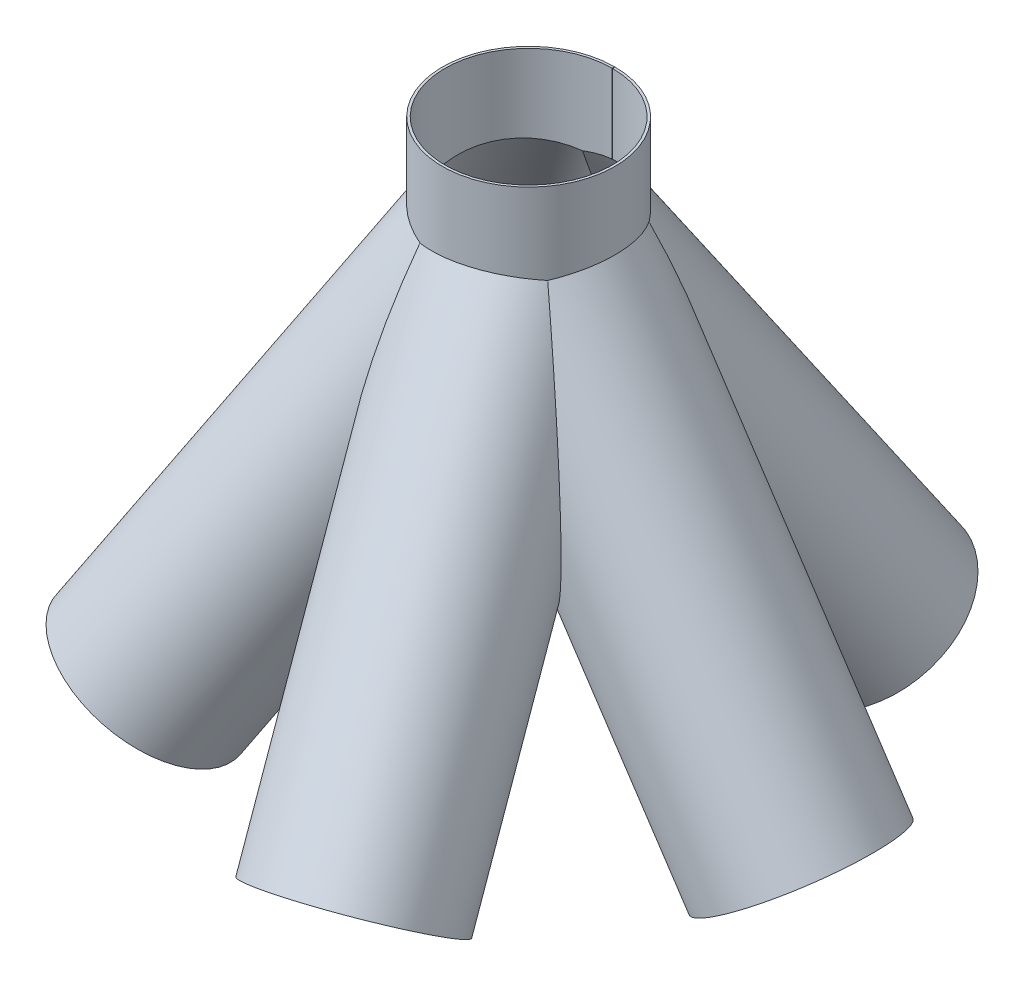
ISO-10303-21;
HEADER;
FILE_DESCRIPTION(('STEP AP214'),'2;1');
FILE_NAME('part.step','',(''),(''),'','','');
FILE_SCHEMA(('AUTOMOTIVE_DESIGN { 1 0 10303 214 1 1 1 1 }'));
ENDSEC;
DATA;
#1=APPLICATION_CONTEXT('core data for automotive mechanical design processes');
#2=APPLICATION_PROTOCOL_DEFINITION('international standard','automotive_design',2000,#1);
#3=PRODUCT_CONTEXT('',#1,'mechanical');
#4=PRODUCT('Part','Part','',(#3));
#5=PRODUCT_RELATED_PRODUCT_CATEGORY('part','',(#4));
#6=PRODUCT_DEFINITION_FORMATION('','',#4);
#7=PRODUCT_DEFINITION_CONTEXT('part definition',#1,'design');
#8=PRODUCT_DEFINITION('design','',#6,#7);
#9=PRODUCT_DEFINITION_SHAPE('','',#8);
#10=(LENGTH_UNIT() NAMED_UNIT(*) SI_UNIT(.MILLI.,.METRE.));
#11=(NAMED_UNIT(*) PLANE_ANGLE_UNIT() SI_UNIT($,.RADIAN.));
#12=(NAMED_UNIT(*) SI_UNIT($,.STERADIAN.) SOLID_ANGLE_UNIT());
#13=UNCERTAINTY_MEASURE_WITH_UNIT(LENGTH_MEASURE(1.E-05),#10,'distance_accuracy_value','');
#14=(GEOMETRIC_REPRESENTATION_CONTEXT(3) GLOBAL_UNCERTAINTY_ASSIGNED_CONTEXT((#13)) GLOBAL_UNIT_ASSIGNED_CONTEXT((#10,
#11,#12)) REPRESENTATION_CONTEXT('',''));
#15=CARTESIAN_POINT('',(0.,0.,0.));
#16=DIRECTION('',(0.,0.,1.));
#17=DIRECTION('',(1.,0.,0.));
#18=AXIS2_PLACEMENT_3D('',#15,#16,#17);
#19=CARTESIAN_POINT('',(0.,2.22044604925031E-13,1.05588484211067E-13));
#20=DIRECTION('',(0.170815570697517,-0.833333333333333,-0.525716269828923));
#21=DIRECTION('',(0.257514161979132,0.552770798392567,-0.792547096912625));
#22=AXIS2_PLACEMENT_3D('',#19,#20,#21);
#23=CYLINDRICAL_SURFACE('',#22,210.);
#24=DIRECTION('',(0.170815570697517,-0.833333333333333,-0.525716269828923));
#25=VECTOR('',#24,1.);
#26=CARTESIAN_POINT('',(-53.6022924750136,-116.081538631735,166.588927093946));
#27=LINE('',#26,#25);
#28=CARTESIAN_POINT('',(151.376392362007,-1116.08153863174,-464.270596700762));
#29=VERTEX_POINT('',#28);
#30=CARTESIAN_POINT('',(0.688190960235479,-380.940704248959,-0.499999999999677));
#31=VERTEX_POINT('',#30);
#32=EDGE_CURVE('E149',#29,#31,#27,.F.);
#33=ORIENTED_EDGE('',*,*,#32,.F.);
#34=CARTESIAN_POINT('',(204.97868483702,-1000.,-630.859523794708));
#35=DIRECTION('',(0.170815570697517,-0.833333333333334,-0.525716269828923));
#36=DIRECTION('',(0.257514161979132,0.552770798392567,-0.792547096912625));
#37=AXIS2_PLACEMENT_3D('',#34,#35,#36);
#38=CIRCLE('',#37,210.);
#39=CARTESIAN_POINT('',(150.425335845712,-1116.08153863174,-464.579613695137));
#40=VERTEX_POINT('',#39);
#41=EDGE_CURVE('E121',#40,#29,#38,.T.);
#42=ORIENTED_EDGE('',*,*,#41,.F.);
#43=DIRECTION('',(0.170815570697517,-0.833333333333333,-0.525716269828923));
#44=VECTOR('',#43,1.);
#45=CARTESIAN_POINT('',(-54.5533489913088,-116.081538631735,166.279910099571));
#46=LINE('',#45,#44);
#47=CARTESIAN_POINT('',(-0.262865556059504,-380.94070424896,-0.809016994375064));
#48=VERTEX_POINT('',#47);
#49=EDGE_CURVE('E106',#40,#48,#46,.F.);
#50=ORIENTED_EDGE('',*,*,#49,.T.);
#51=CARTESIAN_POINT('',(0.,-3.54651129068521E-13,-2.58225511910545E-13));
#52=DIRECTION('',(-0.95105651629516,0.,0.309016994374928));
#53=DIRECTION('',(-0.146120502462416,-0.881139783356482,-0.449712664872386));
#54=AXIS2_PLACEMENT_3D('',#51,#52,#53);
#55=ELLIPSE('',#54,646.331789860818,210.);
#56=CARTESIAN_POINT('',(-64.8935688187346,51.2248383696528,-199.721868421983));
#57=VERTEX_POINT('',#56);
#58=EDGE_CURVE('E139',#48,#57,#55,.F.);
#59=ORIENTED_EDGE('',*,*,#58,.T.);
#60=CARTESIAN_POINT('',(0.,0.,0.));
#61=DIRECTION('',(0.0892055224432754,-0.957427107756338,-0.274546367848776));
#62=DIRECTION('',(0.295861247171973,0.288675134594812,-0.910567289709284));
#63=AXIS2_PLACEMENT_3D('',#60,#61,#62);
#64=ELLIPSE('',#63,219.337846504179,210.);
#65=CARTESIAN_POINT('',(169.893568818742,51.2248383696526,-123.434902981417));
#66=VERTEX_POINT('',#65);
#67=EDGE_CURVE('E122',#66,#57,#64,.F.);
#68=ORIENTED_EDGE('',*,*,#67,.F.);
#69=CARTESIAN_POINT('',(-1.56812562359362E-13,8.19691058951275E-13,4.82619441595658E-13));
#70=DIRECTION('',(-0.58778525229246,0.,-0.809016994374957));
#71=DIRECTION('',(0.382548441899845,-0.881139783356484,-0.277937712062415));
#72=AXIS2_PLACEMENT_3D('',#69,#70,#71);
#73=ELLIPSE('',#72,646.331789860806,210.);
#74=EDGE_CURVE('E127',#31,#66,#73,.F.);
#75=ORIENTED_EDGE('',*,*,#74,.F.);
#76=EDGE_LOOP('',(#33,#42,#50,#59,#68,#75));
#77=FACE_BOUND('',#76,.T.);
#78=ADVANCED_FACE('F54',(#77),#23,.T.);
#79=CARTESIAN_POINT('',(-732.324279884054,250.,-2253.86238007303));
#80=DIRECTION('',(-0.95105651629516,0.,0.309016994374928));
#81=DIRECTION('',(0.309016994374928,0.,0.95105651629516));
#82=AXIS2_PLACEMENT_3D('',#79,#80,#81);
#83=PLANE('',#82);
#84=ORIENTED_EDGE('',*,*,#58,.F.);
#85=DIRECTION('',(0.,1.,0.));
#86=VECTOR('',#85,1.);
#87=CARTESIAN_POINT('',(-0.262865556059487,250.,-0.80901699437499));
#88=LINE('',#87,#86);
#89=CARTESIAN_POINT('',(-0.262865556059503,-370.086264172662,-0.809016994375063));
#90=VERTEX_POINT('',#89);
#91=EDGE_CURVE('E61',#48,#90,#88,.T.);
#92=ORIENTED_EDGE('',*,*,#91,.T.);
#93=CARTESIAN_POINT('',(0.,-3.54651129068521E-13,-2.58225511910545E-13));
#94=DIRECTION('',(-0.95105651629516,0.,0.309016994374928));
#95=DIRECTION('',(-0.146120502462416,-0.881139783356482,-0.449712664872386));
#96=AXIS2_PLACEMENT_3D('',#93,#94,#95);
#97=ELLIPSE('',#96,627.865167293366,204.);
#98=CARTESIAN_POINT('',(-63.0394668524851,49.7612715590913,-194.015529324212));
#99=VERTEX_POINT('',#98);
#100=EDGE_CURVE('E118',#90,#99,#97,.F.);
#101=ORIENTED_EDGE('',*,*,#100,.T.);
#102=DIRECTION('',(-0.300214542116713,0.236979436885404,-0.923965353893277));
#103=VECTOR('',#102,1.);
#104=CARTESIAN_POINT('',(370.769731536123,-292.673371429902,1141.11189883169));
#105=LINE('',#104,#103);
#106=EDGE_CURVE('E153',#99,#57,#105,.T.);
#107=ORIENTED_EDGE('',*,*,#106,.T.);
#108=EDGE_LOOP('',(#84,#92,#101,#107));
#109=FACE_BOUND('',#108,.T.);
#110=ADVANCED_FACE('F136',(#109),#83,.T.);
#111=CARTESIAN_POINT('',(0.,2.22044604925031E-13,1.05588484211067E-13));
#112=DIRECTION('',(0.170815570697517,-0.833333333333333,-0.525716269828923));
#113=DIRECTION('',(0.257514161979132,0.552770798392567,-0.792547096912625));
#114=AXIS2_PLACEMENT_3D('',#111,#112,#113);
#115=CYLINDRICAL_SURFACE('',#114,204.);
#116=CARTESIAN_POINT('',(204.97868483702,-1000.,-630.859523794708));
#117=DIRECTION('',(0.170815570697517,-0.833333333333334,-0.525716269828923));
#118=DIRECTION('',(0.257514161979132,0.552770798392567,-0.792547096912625));
#119=AXIS2_PLACEMENT_3D('',#116,#117,#118);
#120=CIRCLE('',#119,204.);
#121=CARTESIAN_POINT('',(151.970425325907,-1112.76490416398,-469.334910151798));
#122=VERTEX_POINT('',#121);
#123=CARTESIAN_POINT('',(152.921481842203,-1112.76490416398,-469.025893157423));
#124=VERTEX_POINT('',#123);
#125=EDGE_CURVE('E116',#122,#124,#120,.T.);
#126=ORIENTED_EDGE('',*,*,#125,.T.);
#127=DIRECTION('',(0.170815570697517,-0.833333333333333,-0.525716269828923));
#128=VECTOR('',#127,1.);
#129=CARTESIAN_POINT('',(-52.057202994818,-112.764904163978,161.833630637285));
#130=LINE('',#129,#128);
#131=CARTESIAN_POINT('',(0.68819096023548,-370.086264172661,-0.499999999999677));
#132=VERTEX_POINT('',#131);
#133=EDGE_CURVE('E67',#124,#132,#130,.F.);
#134=ORIENTED_EDGE('',*,*,#133,.T.);
#135=CARTESIAN_POINT('',(-1.56812562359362E-13,8.19691058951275E-13,4.82619441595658E-13));
#136=DIRECTION('',(-0.58778525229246,0.,-0.809016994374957));
#137=DIRECTION('',(0.382548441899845,-0.881139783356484,-0.277937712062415));
#138=AXIS2_PLACEMENT_3D('',#135,#136,#137);
#139=ELLIPSE('',#138,627.865167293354,204.);
#140=CARTESIAN_POINT('',(165.039466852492,49.7612715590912,-119.908191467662));
#141=VERTEX_POINT('',#140);
#142=EDGE_CURVE('E155',#132,#141,#139,.F.);
#143=ORIENTED_EDGE('',*,*,#142,.T.);
#144=CARTESIAN_POINT('',(0.,0.,0.));
#145=DIRECTION('',(0.0892055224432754,-0.957427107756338,-0.274546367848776));
#146=DIRECTION('',(0.295861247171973,0.288675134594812,-0.910567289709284));
#147=AXIS2_PLACEMENT_3D('',#144,#145,#146);
#148=ELLIPSE('',#147,213.071050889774,204.);
#149=EDGE_CURVE('E124',#141,#99,#148,.F.);
#150=ORIENTED_EDGE('',*,*,#149,.T.);
#151=ORIENTED_EDGE('',*,*,#100,.F.);
#152=DIRECTION('',(0.170815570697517,-0.833333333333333,-0.525716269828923));
#153=VECTOR('',#152,1.);
#154=CARTESIAN_POINT('',(-53.0082595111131,-112.764904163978,161.52461364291));
#155=LINE('',#154,#153);
#156=EDGE_CURVE('E75',#122,#90,#155,.F.);
#157=ORIENTED_EDGE('',*,*,#156,.F.);
#158=EDGE_LOOP('',(#126,#134,#143,#150,#151,#157));
#159=FACE_BOUND('',#158,.T.);
#160=ADVANCED_FACE('F115',(#159),#115,.F.);
#161=CARTESIAN_POINT('',(2421.6663233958,63.3173823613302,566.040019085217));
#162=DIRECTION('',(0.0892055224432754,-0.957427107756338,-0.274546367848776));
#163=DIRECTION('',(0.295861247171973,0.288675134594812,-0.910567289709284));
#164=AXIS2_PLACEMENT_3D('',#161,#162,#163);
#165=PLANE('',#164);
#166=ORIENTED_EDGE('',*,*,#106,.F.);
#167=ORIENTED_EDGE('',*,*,#149,.F.);
#168=DIRECTION('',(0.7859718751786,0.236979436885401,-0.571041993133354));
#169=VECTOR('',#168,1.);
#170=CARTESIAN_POINT('',(1253.73039683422,378.013937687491,-910.888451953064));
#171=LINE('',#170,#169);
#172=EDGE_CURVE('E132',#141,#66,#171,.T.);
#173=ORIENTED_EDGE('',*,*,#172,.T.);
#174=ORIENTED_EDGE('',*,*,#67,.T.);
#175=EDGE_LOOP('',(#166,#167,#173,#174));
#176=FACE_BOUND('',#175,.T.);
#177=ADVANCED_FACE('F163',(#176),#165,.F.);
#178=CARTESIAN_POINT('',(-1917.24985552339,-1116.08186766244,1392.96355684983));
#179=DIRECTION('',(-0.58778525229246,0.,-0.809016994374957));
#180=DIRECTION('',(-0.809016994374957,0.,0.58778525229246));
#181=AXIS2_PLACEMENT_3D('',#178,#179,#180);
#182=PLANE('',#181);
#183=ORIENTED_EDGE('',*,*,#142,.F.);
#184=DIRECTION('',(0.,-1.,0.));
#185=VECTOR('',#184,1.);
#186=CARTESIAN_POINT('',(0.688190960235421,-1116.08186766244,-0.499999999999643));
#187=LINE('',#186,#185);
#188=EDGE_CURVE('E143',#132,#31,#187,.T.);
#189=ORIENTED_EDGE('',*,*,#188,.T.);
#190=ORIENTED_EDGE('',*,*,#74,.T.);
#191=ORIENTED_EDGE('',*,*,#172,.F.);
#192=EDGE_LOOP('',(#183,#189,#190,#191));
#193=FACE_BOUND('',#192,.T.);
#194=ADVANCED_FACE('F160',(#193),#182,.F.);
#195=CARTESIAN_POINT('',(204.97868483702,-1000.,-630.859523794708));
#196=DIRECTION('',(0.170815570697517,-0.833333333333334,-0.525716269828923));
#197=DIRECTION('',(0.257514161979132,0.552770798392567,-0.792547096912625));
#198=AXIS2_PLACEMENT_3D('',#195,#196,#197);
#199=PLANE('',#198);
#200=DIRECTION('',(-0.257514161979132,-0.552770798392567,0.792547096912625));
#201=VECTOR('',#200,1.);
#202=CARTESIAN_POINT('',(205.454213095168,-1000.,-630.705015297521));
#203=LINE('',#202,#201);
#204=EDGE_CURVE('E13',#124,#29,#203,.T.);
#205=ORIENTED_EDGE('',*,*,#204,.F.);
#206=ORIENTED_EDGE('',*,*,#125,.F.);
#207=DIRECTION('',(-0.257514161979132,-0.552770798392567,0.792547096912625));
#208=VECTOR('',#207,1.);
#209=CARTESIAN_POINT('',(204.503156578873,-1000.,-631.014032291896));
#210=LINE('',#209,#208);
#211=EDGE_CURVE('E103',#122,#40,#210,.T.);
#212=ORIENTED_EDGE('',*,*,#211,.T.);
#213=ORIENTED_EDGE('',*,*,#41,.T.);
#214=EDGE_LOOP('',(#205,#206,#212,#213));
#215=FACE_BOUND('',#214,.T.);
#216=ADVANCED_FACE('F120',(#215),#199,.T.);
#217=CARTESIAN_POINT('',(-55.8906959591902,270.346000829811,170.395840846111));
#218=DIRECTION('',(0.95105651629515,0.,0.309016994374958));
#219=DIRECTION('',(0.309016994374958,0.,-0.95105651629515));
#220=AXIS2_PLACEMENT_3D('',#217,#218,#219);
#221=PLANE('',#220);
#222=ORIENTED_EDGE('',*,*,#211,.F.);
#223=ORIENTED_EDGE('',*,*,#156,.T.);
#224=ORIENTED_EDGE('',*,*,#91,.F.);
#225=ORIENTED_EDGE('',*,*,#49,.F.);
#226=EDGE_LOOP('',(#222,#223,#224,#225));
#227=FACE_BOUND('',#226,.T.);
#228=ADVANCED_FACE('F104',(#227),#221,.T.);
#229=CARTESIAN_POINT('',(-54.939639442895,270.346000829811,170.704857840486));
#230=DIRECTION('',(0.95105651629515,0.,0.309016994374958));
#231=DIRECTION('',(0.309016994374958,0.,-0.95105651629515));
#232=AXIS2_PLACEMENT_3D('',#229,#230,#231);
#233=PLANE('',#232);
#234=ORIENTED_EDGE('',*,*,#32,.T.);
#235=ORIENTED_EDGE('',*,*,#188,.F.);
#236=ORIENTED_EDGE('',*,*,#133,.F.);
#237=ORIENTED_EDGE('',*,*,#204,.T.);
#238=EDGE_LOOP('',(#234,#235,#236,#237));
#239=FACE_BOUND('',#238,.T.);
#240=ADVANCED_FACE('F180',(#239),#233,.F.);
#241=CLOSED_SHELL('',(#78,#110,#160,#177,#194,#216,#228,#240));
#242=MANIFOLD_SOLID_BREP('B2',#241);
#243=CARTESIAN_POINT('',(0.,2.22044604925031E-13,0.));
#244=DIRECTION('',(-0.447200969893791,-0.833333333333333,-0.32491052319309));
#245=DIRECTION('',(-0.674180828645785,0.552770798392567,-0.489821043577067));
#246=AXIS2_PLACEMENT_3D('',#243,#244,#245);
#247=CYLINDRICAL_SURFACE('',#246,210.);
#248=DIRECTION('',(-0.447200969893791,-0.833333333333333,-0.32491052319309));
#249=VECTOR('',#248,1.);
#250=CARTESIAN_POINT('',(141.87146534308,-116.081538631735,102.457619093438));
#251=LINE('',#250,#249);
#252=CARTESIAN_POINT('',(-394.76969852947,-1116.08153863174,-287.43500873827));
#253=VERTEX_POINT('',#252);
#254=CARTESIAN_POINT('',(-0.262865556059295,-380.940704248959,-0.809016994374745));
#255=VERTEX_POINT('',#254);
#256=EDGE_CURVE('E335',#253,#255,#251,.F.);
#257=ORIENTED_EDGE('',*,*,#256,.F.);
#258=CARTESIAN_POINT('',(-536.64116387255,-1000.,-389.892627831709));
#259=DIRECTION('',(-0.447200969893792,-0.833333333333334,-0.324910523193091));
#260=DIRECTION('',(-0.674180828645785,0.552770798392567,-0.489821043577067));
#261=AXIS2_PLACEMENT_3D('',#258,#259,#260);
#262=CIRCLE('',#261,210.);
#263=CARTESIAN_POINT('',(-395.357483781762,-1116.08153863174,-286.625991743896));
#264=VERTEX_POINT('',#263);
#265=EDGE_CURVE('E307',#264,#253,#262,.T.);
#266=ORIENTED_EDGE('',*,*,#265,.F.);
#267=DIRECTION('',(-0.447200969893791,-0.833333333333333,-0.32491052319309));
#268=VECTOR('',#267,1.);
#269=CARTESIAN_POINT('',(141.283680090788,-116.081538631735,103.266636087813));
#270=LINE('',#269,#268);
#271=CARTESIAN_POINT('',(-0.850650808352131,-380.94070424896,0.));
#272=VERTEX_POINT('',#271);
#273=EDGE_CURVE('E292',#264,#272,#270,.F.);
#274=ORIENTED_EDGE('',*,*,#273,.T.);
#275=CARTESIAN_POINT('',(-2.19659740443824E-13,-3.54651129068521E-13,-1.5959214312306E-13));
#276=DIRECTION('',(0.,0.,1.));
#277=DIRECTION('',(-0.472855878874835,-0.881139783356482,0.));
#278=AXIS2_PLACEMENT_3D('',#275,#276,#277);
#279=ELLIPSE('',#278,646.331789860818,210.);
#280=CARTESIAN_POINT('',(-209.999999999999,51.2248383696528,-3.71924713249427E-12));
#281=VERTEX_POINT('',#280);
#282=EDGE_CURVE('E325',#272,#281,#279,.F.);
#283=ORIENTED_EDGE('',*,*,#282,.T.);
#284=CARTESIAN_POINT('',(0.,0.,0.));
#285=DIRECTION('',(-0.233543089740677,-0.957427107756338,-0.169678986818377));
#286=DIRECTION('',(-0.774574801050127,0.288675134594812,-0.562761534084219));
#287=AXIS2_PLACEMENT_3D('',#284,#285,#286);
#288=ELLIPSE('',#287,219.337846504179,210.);
#289=CARTESIAN_POINT('',(-64.8935688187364,51.2248383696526,-199.721868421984));
#290=VERTEX_POINT('',#289);
#291=EDGE_CURVE('E308',#290,#281,#288,.F.);
#292=ORIENTED_EDGE('',*,*,#291,.F.);
#293=CARTESIAN_POINT('',(4.10540618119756E-13,8.19691058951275E-13,2.98275218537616E-13));
#294=DIRECTION('',(-0.951056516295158,0.,0.309016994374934));
#295=DIRECTION('',(-0.146120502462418,-0.881139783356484,-0.449712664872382));
#296=AXIS2_PLACEMENT_3D('',#293,#294,#295);
#297=ELLIPSE('',#296,646.331789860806,210.);
#298=EDGE_CURVE('E313',#255,#290,#297,.F.);
#299=ORIENTED_EDGE('',*,*,#298,.F.);
#300=EDGE_LOOP('',(#257,#266,#274,#283,#292,#299));
#301=FACE_BOUND('',#300,.T.);
#302=ADVANCED_FACE('F240',(#301),#247,.T.);
#303=CARTESIAN_POINT('',(-2369.85115127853,250.,-4.17443857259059E-11));
#304=DIRECTION('',(0.,0.,1.));
#305=DIRECTION('',(1.,0.,0.));
#306=AXIS2_PLACEMENT_3D('',#303,#304,#305);
#307=PLANE('',#306);
#308=ORIENTED_EDGE('',*,*,#282,.F.);
#309=DIRECTION('',(0.,1.,0.));
#310=VECTOR('',#309,1.);
#311=CARTESIAN_POINT('',(-0.850650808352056,250.,0.));
#312=LINE('',#311,#310);
#313=CARTESIAN_POINT('',(-0.85065080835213,-370.086264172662,0.));
#314=VERTEX_POINT('',#313);
#315=EDGE_CURVE('E247',#272,#314,#312,.T.);
#316=ORIENTED_EDGE('',*,*,#315,.T.);
#317=CARTESIAN_POINT('',(-2.19659740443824E-13,-3.54651129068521E-13,-1.5959214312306E-13));
#318=DIRECTION('',(0.,0.,1.));
#319=DIRECTION('',(-0.472855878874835,-0.881139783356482,0.));
#320=AXIS2_PLACEMENT_3D('',#317,#318,#319);
#321=ELLIPSE('',#320,627.865167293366,204.);
#322=CARTESIAN_POINT('',(-203.999999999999,49.7612715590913,-3.59434704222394E-12));
#323=VERTEX_POINT('',#322);
#324=EDGE_CURVE('E304',#314,#323,#321,.F.);
#325=ORIENTED_EDGE('',*,*,#324,.T.);
#326=DIRECTION('',(-0.971514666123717,0.236979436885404,0.));
#327=VECTOR('',#326,1.);
#328=CARTESIAN_POINT('',(1199.83605525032,-292.673371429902,2.12052597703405E-11));
#329=LINE('',#328,#327);
#330=EDGE_CURVE('E339',#323,#281,#329,.T.);
#331=ORIENTED_EDGE('',*,*,#330,.T.);
#332=EDGE_LOOP('',(#308,#316,#325,#331));
#333=FACE_BOUND('',#332,.T.);
#334=ADVANCED_FACE('F322',(#333),#307,.T.);
#335=CARTESIAN_POINT('',(0.,2.22044604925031E-13,0.));
#336=DIRECTION('',(-0.447200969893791,-0.833333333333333,-0.32491052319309));
#337=DIRECTION('',(-0.674180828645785,0.552770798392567,-0.489821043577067));
#338=AXIS2_PLACEMENT_3D('',#335,#336,#337);
#339=CYLINDRICAL_SURFACE('',#338,204.);
#340=CARTESIAN_POINT('',(-536.64116387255,-1000.,-389.892627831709));
#341=DIRECTION('',(-0.447200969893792,-0.833333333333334,-0.324910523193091));
#342=DIRECTION('',(-0.674180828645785,0.552770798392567,-0.489821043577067));
#343=AXIS2_PLACEMENT_3D('',#340,#341,#342);
#344=CIRCLE('',#343,204.);
#345=CARTESIAN_POINT('',(-399.402580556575,-1112.76490416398,-289.564926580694));
#346=VERTEX_POINT('',#345);
#347=CARTESIAN_POINT('',(-398.814795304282,-1112.76490416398,-290.373943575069));
#348=VERTEX_POINT('',#347);
#349=EDGE_CURVE('E302',#346,#348,#344,.T.);
#350=ORIENTED_EDGE('',*,*,#349,.T.);
#351=DIRECTION('',(-0.447200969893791,-0.833333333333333,-0.32491052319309));
#352=VECTOR('',#351,1.);
#353=CARTESIAN_POINT('',(137.826368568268,-112.764904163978,99.5186842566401));
#354=LINE('',#353,#352);
#355=CARTESIAN_POINT('',(-0.262865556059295,-370.086264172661,-0.809016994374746));
#356=VERTEX_POINT('',#355);
#357=EDGE_CURVE('E253',#348,#356,#354,.F.);
#358=ORIENTED_EDGE('',*,*,#357,.T.);
#359=CARTESIAN_POINT('',(4.10540618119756E-13,8.19691058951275E-13,2.98275218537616E-13));
#360=DIRECTION('',(-0.951056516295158,0.,0.309016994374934));
#361=DIRECTION('',(-0.146120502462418,-0.881139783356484,-0.449712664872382));
#362=AXIS2_PLACEMENT_3D('',#359,#360,#361);
#363=ELLIPSE('',#362,627.865167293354,204.);
#364=CARTESIAN_POINT('',(-63.0394668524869,49.7612715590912,-194.015529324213));
#365=VERTEX_POINT('',#364);
#366=EDGE_CURVE('E341',#356,#365,#363,.F.);
#367=ORIENTED_EDGE('',*,*,#366,.T.);
#368=CARTESIAN_POINT('',(0.,0.,0.));
#369=DIRECTION('',(-0.233543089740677,-0.957427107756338,-0.169678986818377));
#370=DIRECTION('',(-0.774574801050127,0.288675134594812,-0.562761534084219));
#371=AXIS2_PLACEMENT_3D('',#368,#369,#370);
#372=ELLIPSE('',#371,213.071050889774,204.);
#373=EDGE_CURVE('E310',#365,#323,#372,.F.);
#374=ORIENTED_EDGE('',*,*,#373,.T.);
#375=ORIENTED_EDGE('',*,*,#324,.F.);
#376=DIRECTION('',(-0.447200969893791,-0.833333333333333,-0.32491052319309));
#377=VECTOR('',#376,1.);
#378=CARTESIAN_POINT('',(137.238583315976,-112.764904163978,100.327701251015));
#379=LINE('',#378,#377);
#380=EDGE_CURVE('E261',#346,#314,#379,.F.);
#381=ORIENTED_EDGE('',*,*,#380,.F.);
#382=EDGE_LOOP('',(#350,#358,#367,#374,#375,#381));
#383=FACE_BOUND('',#382,.T.);
#384=ADVANCED_FACE('F301',(#383),#339,.F.);
#385=CARTESIAN_POINT('',(1286.67209726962,63.3173823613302,-2128.22555176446));
#386=DIRECTION('',(-0.233543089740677,-0.957427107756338,-0.169678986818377));
#387=DIRECTION('',(-0.774574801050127,0.288675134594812,-0.562761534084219));
#388=AXIS2_PLACEMENT_3D('',#385,#386,#387);
#389=PLANE('',#388);
#390=ORIENTED_EDGE('',*,*,#330,.F.);
#391=ORIENTED_EDGE('',*,*,#373,.F.);
#392=DIRECTION('',(-0.300214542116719,0.236979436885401,-0.923965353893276));
#393=VECTOR('',#392,1.);
#394=CARTESIAN_POINT('',(-478.882398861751,378.013937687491,-1473.84847521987));
#395=LINE('',#394,#393);
#396=EDGE_CURVE('E318',#365,#290,#395,.T.);
#397=ORIENTED_EDGE('',*,*,#396,.T.);
#398=ORIENTED_EDGE('',*,*,#291,.T.);
#399=EDGE_LOOP('',(#390,#391,#397,#398));
#400=FACE_BOUND('',#399,.T.);
#401=ADVANCED_FACE('F349',(#400),#389,.F.);
#402=CARTESIAN_POINT('',(732.32427988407,-1116.08186766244,2253.86238007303));
#403=DIRECTION('',(-0.951056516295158,0.,0.309016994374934));
#404=DIRECTION('',(0.309016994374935,0.,0.951056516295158));
#405=AXIS2_PLACEMENT_3D('',#402,#403,#404);
#406=PLANE('',#405);
#407=ORIENTED_EDGE('',*,*,#366,.F.);
#408=DIRECTION('',(0.,-1.,0.));
#409=VECTOR('',#408,1.);
#410=CARTESIAN_POINT('',(-0.262865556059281,-1116.08186766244,-0.809016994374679));
#411=LINE('',#410,#409);
#412=EDGE_CURVE('E329',#356,#255,#411,.T.);
#413=ORIENTED_EDGE('',*,*,#412,.T.);
#414=ORIENTED_EDGE('',*,*,#298,.T.);
#415=ORIENTED_EDGE('',*,*,#396,.F.);
#416=EDGE_LOOP('',(#407,#413,#414,#415));
#417=FACE_BOUND('',#416,.T.);
#418=ADVANCED_FACE('F346',(#417),#406,.F.);
#419=CARTESIAN_POINT('',(-536.64116387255,-1000.,-389.892627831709));
#420=DIRECTION('',(-0.447200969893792,-0.833333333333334,-0.324910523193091));
#421=DIRECTION('',(-0.674180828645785,0.552770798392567,-0.489821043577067));
#422=AXIS2_PLACEMENT_3D('',#419,#420,#421);
#423=PLANE('',#422);
#424=DIRECTION('',(0.674180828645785,-0.552770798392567,0.489821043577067));
#425=VECTOR('',#424,1.);
#426=CARTESIAN_POINT('',(-536.347271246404,-1000.,-390.297136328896));
#427=LINE('',#426,#425);
#428=EDGE_CURVE('E52',#348,#253,#427,.T.);
#429=ORIENTED_EDGE('',*,*,#428,.F.);
#430=ORIENTED_EDGE('',*,*,#349,.F.);
#431=DIRECTION('',(0.674180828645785,-0.552770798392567,0.489821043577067));
#432=VECTOR('',#431,1.);
#433=CARTESIAN_POINT('',(-536.935056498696,-1000.,-389.488119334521));
#434=LINE('',#433,#432);
#435=EDGE_CURVE('E289',#346,#264,#434,.T.);
#436=ORIENTED_EDGE('',*,*,#435,.T.);
#437=ORIENTED_EDGE('',*,*,#265,.T.);
#438=EDGE_LOOP('',(#429,#430,#436,#437));
#439=FACE_BOUND('',#438,.T.);
#440=ADVANCED_FACE('F306',(#439),#423,.T.);
#441=CARTESIAN_POINT('',(144.784899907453,270.346000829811,105.810421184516));
#442=DIRECTION('',(0.58778525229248,0.,-0.809016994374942));
#443=DIRECTION('',(-0.809016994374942,0.,-0.58778525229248));
#444=AXIS2_PLACEMENT_3D('',#441,#442,#443);
#445=PLANE('',#444);
#446=ORIENTED_EDGE('',*,*,#435,.F.);
#447=ORIENTED_EDGE('',*,*,#380,.T.);
#448=ORIENTED_EDGE('',*,*,#315,.F.);
#449=ORIENTED_EDGE('',*,*,#273,.F.);
#450=EDGE_LOOP('',(#446,#447,#448,#449));
#451=FACE_BOUND('',#450,.T.);
#452=ADVANCED_FACE('F290',(#451),#445,.T.);
#453=CARTESIAN_POINT('',(145.372685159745,270.346000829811,105.001404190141));
#454=DIRECTION('',(0.58778525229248,0.,-0.809016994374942));
#455=DIRECTION('',(-0.809016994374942,0.,-0.58778525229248));
#456=AXIS2_PLACEMENT_3D('',#453,#454,#455);
#457=PLANE('',#456);
#458=ORIENTED_EDGE('',*,*,#256,.T.);
#459=ORIENTED_EDGE('',*,*,#412,.F.);
#460=ORIENTED_EDGE('',*,*,#357,.F.);
#461=ORIENTED_EDGE('',*,*,#428,.T.);
#462=EDGE_LOOP('',(#458,#459,#460,#461));
#463=FACE_BOUND('',#462,.T.);
#464=ADVANCED_FACE('F366',(#463),#457,.F.);
#465=CLOSED_SHELL('',(#302,#334,#384,#401,#418,#440,#452,#464));
#466=MANIFOLD_SOLID_BREP('B7',#465);
#467=CARTESIAN_POINT('',(0.,2.22044604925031E-13,0.));
#468=DIRECTION('',(-0.447200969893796,-0.833333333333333,0.324910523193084));
#469=DIRECTION('',(-0.674180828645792,0.552770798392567,0.489821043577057));
#470=AXIS2_PLACEMENT_3D('',#467,#468,#469);
#471=CYLINDRICAL_SURFACE('',#470,210.);
#472=DIRECTION('',(-0.447200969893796,-0.833333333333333,0.324910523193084));
#473=VECTOR('',#472,1.);
#474=CARTESIAN_POINT('',(141.283680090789,-116.081538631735,-103.266636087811));
#475=LINE('',#474,#473);
#476=CARTESIAN_POINT('',(-395.357483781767,-1116.08153863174,286.62599174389));
#477=VERTEX_POINT('',#476);
#478=CARTESIAN_POINT('',(-0.850650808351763,-380.940704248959,-1.93584297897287E-13));
#479=VERTEX_POINT('',#478);
#480=EDGE_CURVE('E521',#477,#479,#475,.F.);
#481=ORIENTED_EDGE('',*,*,#480,.F.);
#482=CARTESIAN_POINT('',(-536.641163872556,-1000.,389.892627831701));
#483=DIRECTION('',(-0.447200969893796,-0.833333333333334,0.324910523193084));
#484=DIRECTION('',(-0.674180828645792,0.552770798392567,0.489821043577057));
#485=AXIS2_PLACEMENT_3D('',#482,#483,#484);
#486=CIRCLE('',#485,210.);
#487=CARTESIAN_POINT('',(-394.769698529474,-1116.08153863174,287.435008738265));
#488=VERTEX_POINT('',#487);
#489=EDGE_CURVE('E493',#488,#477,#486,.T.);
#490=ORIENTED_EDGE('',*,*,#489,.F.);
#491=DIRECTION('',(-0.447200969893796,-0.833333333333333,0.324910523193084));
#492=VECTOR('',#491,1.);
#493=CARTESIAN_POINT('',(141.871465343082,-116.081538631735,-102.457619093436));
#494=LINE('',#493,#492);
#495=CARTESIAN_POINT('',(-0.262865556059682,-380.94070424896,0.809016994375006));
#496=VERTEX_POINT('',#495);
#497=EDGE_CURVE('E478',#488,#496,#494,.F.);
#498=ORIENTED_EDGE('',*,*,#497,.T.);
#499=CARTESIAN_POINT('',(-2.19659740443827E-13,-3.54651129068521E-13,1.59592143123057E-13));
#500=DIRECTION('',(0.951056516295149,0.,0.309016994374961));
#501=DIRECTION('',(-0.146120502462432,-0.881139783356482,0.449712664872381));
#502=AXIS2_PLACEMENT_3D('',#499,#500,#501);
#503=ELLIPSE('',#502,646.331789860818,210.);
#504=CARTESIAN_POINT('',(-64.8935688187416,51.2248383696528,199.721868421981));
#505=VERTEX_POINT('',#504);
#506=EDGE_CURVE('E511',#496,#505,#503,.F.);
#507=ORIENTED_EDGE('',*,*,#506,.T.);
#508=CARTESIAN_POINT('',(0.,0.,0.));
#509=DIRECTION('',(-0.233543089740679,-0.957427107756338,0.169678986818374));
#510=DIRECTION('',(-0.774574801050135,0.288675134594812,0.562761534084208));
#511=AXIS2_PLACEMENT_3D('',#508,#509,#510);
#512=ELLIPSE('',#511,219.337846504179,210.);
#513=CARTESIAN_POINT('',(-210.000000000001,51.2248383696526,-2.31759056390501E-12));
#514=VERTEX_POINT('',#513);
#515=EDGE_CURVE('E494',#514,#505,#512,.F.);
#516=ORIENTED_EDGE('',*,*,#515,.F.);
#517=CARTESIAN_POINT('',(4.1054061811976E-13,8.19691058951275E-13,-2.9827521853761E-13));
#518=DIRECTION('',(0.,0.,1.));
#519=DIRECTION('',(-0.472855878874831,-0.881139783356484,0.));
#520=AXIS2_PLACEMENT_3D('',#517,#518,#519);
#521=ELLIPSE('',#520,646.331789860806,210.);
#522=EDGE_CURVE('E499',#479,#514,#521,.F.);
#523=ORIENTED_EDGE('',*,*,#522,.F.);
#524=EDGE_LOOP('',(#481,#490,#498,#507,#516,#523));
#525=FACE_BOUND('',#524,.T.);
#526=ADVANCED_FACE('F426',(#525),#471,.T.);
#527=CARTESIAN_POINT('',(-732.324279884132,250.,2253.86238007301));
#528=DIRECTION('',(0.951056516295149,0.,0.309016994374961));
#529=DIRECTION('',(0.309016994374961,0.,-0.951056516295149));
#530=AXIS2_PLACEMENT_3D('',#527,#528,#529);
#531=PLANE('',#530);
#532=ORIENTED_EDGE('',*,*,#506,.F.);
#533=DIRECTION('',(0.,1.,0.));
#534=VECTOR('',#533,1.);
#535=CARTESIAN_POINT('',(-0.262865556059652,250.,0.809016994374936));
#536=LINE('',#535,#534);
#537=CARTESIAN_POINT('',(-0.262865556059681,-370.086264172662,0.809016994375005));
#538=VERTEX_POINT('',#537);
#539=EDGE_CURVE('E433',#496,#538,#536,.T.);
#540=ORIENTED_EDGE('',*,*,#539,.T.);
#541=CARTESIAN_POINT('',(-2.19659740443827E-13,-3.54651129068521E-13,1.59592143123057E-13));
#542=DIRECTION('',(0.951056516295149,0.,0.309016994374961));
#543=DIRECTION('',(-0.146120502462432,-0.881139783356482,0.449712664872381));
#544=AXIS2_PLACEMENT_3D('',#541,#542,#543);
#545=ELLIPSE('',#544,627.865167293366,204.);
#546=CARTESIAN_POINT('',(-63.0394668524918,49.7612715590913,194.01552932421));
#547=VERTEX_POINT('',#546);
#548=EDGE_CURVE('E490',#538,#547,#545,.F.);
#549=ORIENTED_EDGE('',*,*,#548,.T.);
#550=DIRECTION('',(-0.300214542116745,0.236979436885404,0.923965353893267));
#551=VECTOR('',#550,1.);
#552=CARTESIAN_POINT('',(370.769731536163,-292.673371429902,-1141.11189883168));
#553=LINE('',#552,#551);
#554=EDGE_CURVE('E525',#547,#505,#553,.T.);
#555=ORIENTED_EDGE('',*,*,#554,.T.);
#556=EDGE_LOOP('',(#532,#540,#549,#555));
#557=FACE_BOUND('',#556,.T.);
#558=ADVANCED_FACE('F508',(#557),#531,.T.);
#559=CARTESIAN_POINT('',(0.,2.22044604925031E-13,0.));
#560=DIRECTION('',(-0.447200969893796,-0.833333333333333,0.324910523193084));
#561=DIRECTION('',(-0.674180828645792,0.552770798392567,0.489821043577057));
#562=AXIS2_PLACEMENT_3D('',#559,#560,#561);
#563=CYLINDRICAL_SURFACE('',#562,204.);
#564=CARTESIAN_POINT('',(-536.641163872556,-1000.,389.892627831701));
#565=DIRECTION('',(-0.447200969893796,-0.833333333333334,0.324910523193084));
#566=DIRECTION('',(-0.674180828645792,0.552770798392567,0.489821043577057));
#567=AXIS2_PLACEMENT_3D('',#564,#565,#566);
#568=CIRCLE('',#567,204.);
#569=CARTESIAN_POINT('',(-398.814795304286,-1112.76490416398,290.373943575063));
#570=VERTEX_POINT('',#569);
#571=CARTESIAN_POINT('',(-399.402580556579,-1112.76490416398,289.564926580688));
#572=VERTEX_POINT('',#571);
#573=EDGE_CURVE('E488',#570,#572,#568,.T.);
#574=ORIENTED_EDGE('',*,*,#573,.T.);
#575=DIRECTION('',(-0.447200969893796,-0.833333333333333,0.324910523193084));
#576=VECTOR('',#575,1.);
#577=CARTESIAN_POINT('',(137.238583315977,-112.764904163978,-100.327701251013));
#578=LINE('',#577,#576);
#579=CARTESIAN_POINT('',(-0.850650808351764,-370.086264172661,-1.93692718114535E-13));
#580=VERTEX_POINT('',#579);
#581=EDGE_CURVE('E439',#572,#580,#578,.F.);
#582=ORIENTED_EDGE('',*,*,#581,.T.);
#583=CARTESIAN_POINT('',(4.1054061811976E-13,8.19691058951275E-13,-2.9827521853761E-13));
#584=DIRECTION('',(0.,0.,1.));
#585=DIRECTION('',(-0.472855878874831,-0.881139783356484,0.));
#586=AXIS2_PLACEMENT_3D('',#583,#584,#585);
#587=ELLIPSE('',#586,627.865167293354,204.);
#588=CARTESIAN_POINT('',(-204.000000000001,49.7612715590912,-2.13717932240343E-12));
#589=VERTEX_POINT('',#588);
#590=EDGE_CURVE('E527',#580,#589,#587,.F.);
#591=ORIENTED_EDGE('',*,*,#590,.T.);
#592=CARTESIAN_POINT('',(0.,0.,0.));
#593=DIRECTION('',(-0.233543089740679,-0.957427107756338,0.169678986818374));
#594=DIRECTION('',(-0.774574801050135,0.288675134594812,0.562761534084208));
#595=AXIS2_PLACEMENT_3D('',#592,#593,#594);
#596=ELLIPSE('',#595,213.071050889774,204.);
#597=EDGE_CURVE('E496',#589,#547,#596,.F.);
#598=ORIENTED_EDGE('',*,*,#597,.T.);
#599=ORIENTED_EDGE('',*,*,#548,.F.);
#600=DIRECTION('',(-0.447200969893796,-0.833333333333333,0.324910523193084));
#601=VECTOR('',#600,1.);
#602=CARTESIAN_POINT('',(137.82636856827,-112.764904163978,-99.5186842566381));
#603=LINE('',#602,#601);
#604=EDGE_CURVE('E447',#570,#538,#603,.F.);
#605=ORIENTED_EDGE('',*,*,#604,.F.);
#606=EDGE_LOOP('',(#574,#582,#591,#598,#599,#605));
#607=FACE_BOUND('',#606,.T.);
#608=ADVANCED_FACE('F487',(#607),#563,.F.);
#609=CARTESIAN_POINT('',(-1626.45923490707,63.3173823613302,-1881.35574580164));
#610=DIRECTION('',(-0.233543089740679,-0.957427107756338,0.169678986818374));
#611=DIRECTION('',(-0.774574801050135,0.288675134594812,0.562761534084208));
#612=AXIS2_PLACEMENT_3D('',#609,#610,#611);
#613=PLANE('',#612);
#614=ORIENTED_EDGE('',*,*,#554,.F.);
#615=ORIENTED_EDGE('',*,*,#597,.F.);
#616=DIRECTION('',(-0.971514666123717,0.236979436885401,0.));
#617=VECTOR('',#616,1.);
#618=CARTESIAN_POINT('',(-1549.69599594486,378.013937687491,-1.63202784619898E-11));
#619=LINE('',#618,#617);
#620=EDGE_CURVE('E504',#589,#514,#619,.T.);
#621=ORIENTED_EDGE('',*,*,#620,.T.);
#622=ORIENTED_EDGE('',*,*,#515,.T.);
#623=EDGE_LOOP('',(#614,#615,#621,#622));
#624=FACE_BOUND('',#623,.T.);
#625=ADVANCED_FACE('F535',(#624),#613,.F.);
#626=CARTESIAN_POINT('',(2369.85115127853,-1116.08186766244,2.48689957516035E-11));
#627=DIRECTION('',(0.,0.,1.));
#628=DIRECTION('',(1.,0.,0.));
#629=AXIS2_PLACEMENT_3D('',#626,#627,#628);
#630=PLANE('',#629);
#631=ORIENTED_EDGE('',*,*,#590,.F.);
#632=DIRECTION('',(0.,-1.,0.));
#633=VECTOR('',#632,1.);
#634=CARTESIAN_POINT('',(-0.850650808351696,-1116.08186766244,-1.86374353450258E-13));
#635=LINE('',#634,#633);
#636=EDGE_CURVE('E515',#580,#479,#635,.T.);
#637=ORIENTED_EDGE('',*,*,#636,.T.);
#638=ORIENTED_EDGE('',*,*,#522,.T.);
#639=ORIENTED_EDGE('',*,*,#620,.F.);
#640=EDGE_LOOP('',(#631,#637,#638,#639));
#641=FACE_BOUND('',#640,.T.);
#642=ADVANCED_FACE('F532',(#641),#630,.F.);
#643=CARTESIAN_POINT('',(-536.641163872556,-1000.,389.892627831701));
#644=DIRECTION('',(-0.447200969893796,-0.833333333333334,0.324910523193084));
#645=DIRECTION('',(-0.674180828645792,0.552770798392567,0.489821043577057));
#646=AXIS2_PLACEMENT_3D('',#643,#644,#645);
#647=PLANE('',#646);
#648=DIRECTION('',(0.674180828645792,-0.552770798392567,-0.489821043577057));
#649=VECTOR('',#648,1.);
#650=CARTESIAN_POINT('',(-536.935056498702,-1000.,389.488119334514));
#651=LINE('',#650,#649);
#652=EDGE_CURVE('E238',#572,#477,#651,.T.);
#653=ORIENTED_EDGE('',*,*,#652,.F.);
#654=ORIENTED_EDGE('',*,*,#573,.F.);
#655=DIRECTION('',(0.674180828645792,-0.552770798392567,-0.489821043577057));
#656=VECTOR('',#655,1.);
#657=CARTESIAN_POINT('',(-536.347271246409,-1000.,390.297136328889));
#658=LINE('',#657,#656);
#659=EDGE_CURVE('E475',#570,#488,#658,.T.);
#660=ORIENTED_EDGE('',*,*,#659,.T.);
#661=ORIENTED_EDGE('',*,*,#489,.T.);
#662=EDGE_LOOP('',(#653,#654,#660,#661));
#663=FACE_BOUND('',#662,.T.);
#664=ADVANCED_FACE('F492',(#663),#647,.T.);
#665=CARTESIAN_POINT('',(145.372685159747,270.346000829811,-105.001404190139));
#666=DIRECTION('',(-0.587785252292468,0.,-0.809016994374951));
#667=DIRECTION('',(-0.809016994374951,0.,0.587785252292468));
#668=AXIS2_PLACEMENT_3D('',#665,#666,#667);
#669=PLANE('',#668);
#670=ORIENTED_EDGE('',*,*,#659,.F.);
#671=ORIENTED_EDGE('',*,*,#604,.T.);
#672=ORIENTED_EDGE('',*,*,#539,.F.);
#673=ORIENTED_EDGE('',*,*,#497,.F.);
#674=EDGE_LOOP('',(#670,#671,#672,#673));
#675=FACE_BOUND('',#674,.T.);
#676=ADVANCED_FACE('F476',(#675),#669,.T.);
#677=CARTESIAN_POINT('',(144.784899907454,270.346000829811,-105.810421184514));
#678=DIRECTION('',(-0.587785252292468,0.,-0.809016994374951));
#679=DIRECTION('',(-0.809016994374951,0.,0.587785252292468));
#680=AXIS2_PLACEMENT_3D('',#677,#678,#679);
#681=PLANE('',#680);
#682=ORIENTED_EDGE('',*,*,#480,.T.);
#683=ORIENTED_EDGE('',*,*,#636,.F.);
#684=ORIENTED_EDGE('',*,*,#581,.F.);
#685=ORIENTED_EDGE('',*,*,#652,.T.);
#686=EDGE_LOOP('',(#682,#683,#684,#685));
#687=FACE_BOUND('',#686,.T.);
#688=ADVANCED_FACE('F552',(#687),#681,.F.);
#689=CLOSED_SHELL('',(#526,#558,#608,#625,#642,#664,#676,#688));
#690=MANIFOLD_SOLID_BREP('B46',#689);
#691=CARTESIAN_POINT('',(0.,2.22044604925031E-13,-1.05588484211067E-13));
#692=DIRECTION('',(0.170815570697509,-0.833333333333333,0.525716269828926));
#693=DIRECTION('',(0.257514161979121,0.552770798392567,0.792547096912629));
#694=AXIS2_PLACEMENT_3D('',#691,#692,#693);
#695=CYLINDRICAL_SURFACE('',#694,210.);
#696=DIRECTION('',(0.170815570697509,-0.833333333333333,0.525716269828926));
#697=VECTOR('',#696,1.);
#698=CARTESIAN_POINT('',(-54.5533489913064,-116.081538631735,-166.279910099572));
#699=LINE('',#698,#697);
#700=CARTESIAN_POINT('',(150.425335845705,-1116.08153863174,464.57961369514));
#701=VERTEX_POINT('',#700);
#702=CARTESIAN_POINT('',(-0.262865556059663,-380.940704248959,0.809016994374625));
#703=VERTEX_POINT('',#702);
#704=EDGE_CURVE('E707',#701,#703,#699,.F.);
#705=ORIENTED_EDGE('',*,*,#704,.F.);
#706=CARTESIAN_POINT('',(204.978684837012,-1000.,630.859523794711));
#707=DIRECTION('',(0.17081557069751,-0.833333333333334,0.525716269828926));
#708=DIRECTION('',(0.257514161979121,0.552770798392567,0.792547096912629));
#709=AXIS2_PLACEMENT_3D('',#706,#707,#708);
#710=CIRCLE('',#709,210.);
#711=CARTESIAN_POINT('',(151.376392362,-1116.08153863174,464.270596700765));
#712=VERTEX_POINT('',#711);
#713=EDGE_CURVE('E679',#712,#701,#710,.T.);
#714=ORIENTED_EDGE('',*,*,#713,.F.);
#715=DIRECTION('',(0.170815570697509,-0.833333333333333,0.525716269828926));
#716=VECTOR('',#715,1.);
#717=CARTESIAN_POINT('',(-53.6022924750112,-116.081538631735,-166.588927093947));
#718=LINE('',#717,#716);
#719=CARTESIAN_POINT('',(0.688190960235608,-380.94070424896,0.500000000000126));
#720=VERTEX_POINT('',#719);
#721=EDGE_CURVE('E664',#712,#720,#718,.F.);
#722=ORIENTED_EDGE('',*,*,#721,.T.);
#723=CARTESIAN_POINT('',(0.,-3.54651129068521E-13,2.58225511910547E-13));
#724=DIRECTION('',(0.587785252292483,0.,-0.809016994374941));
#725=DIRECTION('',(0.38254844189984,-0.881139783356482,0.277937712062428));
#726=AXIS2_PLACEMENT_3D('',#723,#724,#725);
#727=ELLIPSE('',#726,646.331789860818,210.);
#728=CARTESIAN_POINT('',(169.893568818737,51.2248383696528,123.434902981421));
#729=VERTEX_POINT('',#728);
#730=EDGE_CURVE('E697',#720,#729,#727,.F.);
#731=ORIENTED_EDGE('',*,*,#730,.T.);
#732=CARTESIAN_POINT('',(0.,0.,0.));
#733=DIRECTION('',(0.0892055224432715,-0.957427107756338,0.274546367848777));
#734=DIRECTION('',(0.29586124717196,0.288675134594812,0.910567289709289));
#735=AXIS2_PLACEMENT_3D('',#732,#733,#734);
#736=ELLIPSE('',#735,219.337846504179,210.);
#737=CARTESIAN_POINT('',(-64.8935688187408,51.2248383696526,199.721868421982));
#738=VERTEX_POINT('',#737);
#739=EDGE_CURVE('E680',#738,#729,#736,.F.);
#740=ORIENTED_EDGE('',*,*,#739,.F.);
#741=CARTESIAN_POINT('',(-1.56812562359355E-13,8.19691058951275E-13,-4.8261944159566E-13));
#742=DIRECTION('',(0.951056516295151,0.,0.309016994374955));
#743=DIRECTION('',(-0.146120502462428,-0.881139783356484,0.449712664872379));
#744=AXIS2_PLACEMENT_3D('',#741,#742,#743);
#745=ELLIPSE('',#744,646.331789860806,210.);
#746=EDGE_CURVE('E685',#703,#738,#745,.F.);
#747=ORIENTED_EDGE('',*,*,#746,.F.);
#748=EDGE_LOOP('',(#705,#714,#722,#731,#740,#747));
#749=FACE_BOUND('',#748,.T.);
#750=ADVANCED_FACE('F612',(#749),#695,.T.);
#751=CARTESIAN_POINT('',(1917.24985552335,250.,1392.96355684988));
#752=DIRECTION('',(0.587785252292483,0.,-0.809016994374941));
#753=DIRECTION('',(-0.809016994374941,0.,-0.587785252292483));
#754=AXIS2_PLACEMENT_3D('',#751,#752,#753);
#755=PLANE('',#754);
#756=ORIENTED_EDGE('',*,*,#730,.F.);
#757=DIRECTION('',(0.,1.,0.));
#758=VECTOR('',#757,1.);
#759=CARTESIAN_POINT('',(0.688190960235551,250.,0.500000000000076));
#760=LINE('',#759,#758);
#761=CARTESIAN_POINT('',(0.688190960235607,-370.086264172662,0.500000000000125));
#762=VERTEX_POINT('',#761);
#763=EDGE_CURVE('E619',#720,#762,#760,.T.);
#764=ORIENTED_EDGE('',*,*,#763,.T.);
#765=CARTESIAN_POINT('',(0.,-3.54651129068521E-13,2.58225511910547E-13));
#766=DIRECTION('',(0.587785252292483,0.,-0.809016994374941));
#767=DIRECTION('',(0.38254844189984,-0.881139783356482,0.277937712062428));
#768=AXIS2_PLACEMENT_3D('',#765,#766,#767);
#769=ELLIPSE('',#768,627.865167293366,204.);
#770=CARTESIAN_POINT('',(165.039466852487,49.7612715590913,119.908191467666));
#771=VERTEX_POINT('',#770);
#772=EDGE_CURVE('E676',#762,#771,#769,.F.);
#773=ORIENTED_EDGE('',*,*,#772,.T.);
#774=DIRECTION('',(0.785971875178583,0.236979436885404,0.571041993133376));
#775=VECTOR('',#774,1.);
#776=CARTESIAN_POINT('',(-970.687759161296,-292.673371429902,-705.245938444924));
#777=LINE('',#776,#775);
#778=EDGE_CURVE('E711',#771,#729,#777,.T.);
#779=ORIENTED_EDGE('',*,*,#778,.T.);
#780=EDGE_LOOP('',(#756,#764,#773,#779));
#781=FACE_BOUND('',#780,.T.);
#782=ADVANCED_FACE('F694',(#781),#755,.T.);
#783=CARTESIAN_POINT('',(0.,2.22044604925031E-13,-1.05588484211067E-13));
#784=DIRECTION('',(0.170815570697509,-0.833333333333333,0.525716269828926));
#785=DIRECTION('',(0.257514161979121,0.552770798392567,0.792547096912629));
#786=AXIS2_PLACEMENT_3D('',#783,#784,#785);
#787=CYLINDRICAL_SURFACE('',#786,204.);
#788=CARTESIAN_POINT('',(204.978684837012,-1000.,630.859523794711));
#789=DIRECTION('',(0.17081557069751,-0.833333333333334,0.525716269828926));
#790=DIRECTION('',(0.257514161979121,0.552770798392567,0.792547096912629));
#791=AXIS2_PLACEMENT_3D('',#788,#789,#790);
#792=CIRCLE('',#791,204.);
#793=CARTESIAN_POINT('',(152.921481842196,-1112.76490416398,469.025893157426));
#794=VERTEX_POINT('',#793);
#795=CARTESIAN_POINT('',(151.970425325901,-1112.76490416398,469.3349101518));
#796=VERTEX_POINT('',#795);
#797=EDGE_CURVE('E674',#794,#796,#792,.T.);
#798=ORIENTED_EDGE('',*,*,#797,.T.);
#799=DIRECTION('',(0.170815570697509,-0.833333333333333,0.525716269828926));
#800=VECTOR('',#799,1.);
#801=CARTESIAN_POINT('',(-53.0082595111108,-112.764904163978,-161.524613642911));
#802=LINE('',#801,#800);
#803=CARTESIAN_POINT('',(-0.262865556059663,-370.086264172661,0.809016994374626));
#804=VERTEX_POINT('',#803);
#805=EDGE_CURVE('E625',#796,#804,#802,.F.);
#806=ORIENTED_EDGE('',*,*,#805,.T.);
#807=CARTESIAN_POINT('',(-1.56812562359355E-13,8.19691058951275E-13,-4.8261944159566E-13));
#808=DIRECTION('',(0.951056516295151,0.,0.309016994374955));
#809=DIRECTION('',(-0.146120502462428,-0.881139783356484,0.449712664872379));
#810=AXIS2_PLACEMENT_3D('',#807,#808,#809);
#811=ELLIPSE('',#810,627.865167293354,204.);
#812=CARTESIAN_POINT('',(-63.039466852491,49.7612715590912,194.015529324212));
#813=VERTEX_POINT('',#812);
#814=EDGE_CURVE('E713',#804,#813,#811,.F.);
#815=ORIENTED_EDGE('',*,*,#814,.T.);
#816=CARTESIAN_POINT('',(0.,0.,0.));
#817=DIRECTION('',(0.0892055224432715,-0.957427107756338,0.274546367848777));
#818=DIRECTION('',(0.29586124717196,0.288675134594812,0.910567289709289));
#819=AXIS2_PLACEMENT_3D('',#816,#817,#818);
#820=ELLIPSE('',#819,213.071050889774,204.);
#821=EDGE_CURVE('E682',#813,#771,#820,.F.);
#822=ORIENTED_EDGE('',*,*,#821,.T.);
#823=ORIENTED_EDGE('',*,*,#772,.F.);
#824=DIRECTION('',(0.170815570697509,-0.833333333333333,0.525716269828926));
#825=VECTOR('',#824,1.);
#826=CARTESIAN_POINT('',(-52.0572029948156,-112.764904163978,-161.833630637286));
#827=LINE('',#826,#825);
#828=EDGE_CURVE('E633',#794,#762,#827,.F.);
#829=ORIENTED_EDGE('',*,*,#828,.F.);
#830=EDGE_LOOP('',(#798,#806,#815,#822,#823,#829));
#831=FACE_BOUND('',#830,.T.);
#832=ADVANCED_FACE('F673',(#831),#787,.F.);
#833=CARTESIAN_POINT('',(-2291.87918575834,63.3173823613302,965.483755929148));
#834=DIRECTION('',(0.0892055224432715,-0.957427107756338,0.274546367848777));
#835=DIRECTION('',(0.29586124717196,0.288675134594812,0.910567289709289));
#836=AXIS2_PLACEMENT_3D('',#833,#834,#835);
#837=PLANE('',#836);
#838=ORIENTED_EDGE('',*,*,#778,.F.);
#839=ORIENTED_EDGE('',*,*,#821,.F.);
#840=DIRECTION('',(-0.300214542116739,0.236979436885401,0.92396535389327));
#841=VECTOR('',#840,1.);
#842=CARTESIAN_POINT('',(-478.882398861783,378.013937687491,1473.84847521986));
#843=LINE('',#842,#841);
#844=EDGE_CURVE('E690',#813,#738,#843,.T.);
#845=ORIENTED_EDGE('',*,*,#844,.T.);
#846=ORIENTED_EDGE('',*,*,#739,.T.);
#847=EDGE_LOOP('',(#838,#839,#845,#846));
#848=FACE_BOUND('',#847,.T.);
#849=ADVANCED_FACE('F721',(#848),#837,.F.);
#850=CARTESIAN_POINT('',(732.324279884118,-1116.08186766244,-2253.86238007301));
#851=DIRECTION('',(0.951056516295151,0.,0.309016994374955));
#852=DIRECTION('',(0.309016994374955,0.,-0.951056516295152));
#853=AXIS2_PLACEMENT_3D('',#850,#851,#852);
#854=PLANE('',#853);
#855=ORIENTED_EDGE('',*,*,#814,.F.);
#856=DIRECTION('',(0.,-1.,0.));
#857=VECTOR('',#856,1.);
#858=CARTESIAN_POINT('',(-0.262865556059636,-1116.08186766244,0.809016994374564));
#859=LINE('',#858,#857);
#860=EDGE_CURVE('E701',#804,#703,#859,.T.);
#861=ORIENTED_EDGE('',*,*,#860,.T.);
#862=ORIENTED_EDGE('',*,*,#746,.T.);
#863=ORIENTED_EDGE('',*,*,#844,.F.);
#864=EDGE_LOOP('',(#855,#861,#862,#863));
#865=FACE_BOUND('',#864,.T.);
#866=ADVANCED_FACE('F718',(#865),#854,.F.);
#867=CARTESIAN_POINT('',(204.978684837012,-1000.,630.859523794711));
#868=DIRECTION('',(0.17081557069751,-0.833333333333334,0.525716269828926));
#869=DIRECTION('',(0.257514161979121,0.552770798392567,0.792547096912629));
#870=AXIS2_PLACEMENT_3D('',#867,#868,#869);
#871=PLANE('',#870);
#872=DIRECTION('',(-0.257514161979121,-0.552770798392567,-0.792547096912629));
#873=VECTOR('',#872,1.);
#874=CARTESIAN_POINT('',(204.503156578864,-1000.,631.014032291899));
#875=LINE('',#874,#873);
#876=EDGE_CURVE('E424',#796,#701,#875,.T.);
#877=ORIENTED_EDGE('',*,*,#876,.F.);
#878=ORIENTED_EDGE('',*,*,#797,.F.);
#879=DIRECTION('',(-0.257514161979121,-0.552770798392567,-0.792547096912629));
#880=VECTOR('',#879,1.);
#881=CARTESIAN_POINT('',(205.454213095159,-1000.,630.705015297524));
#882=LINE('',#881,#880);
#883=EDGE_CURVE('E661',#794,#712,#882,.T.);
#884=ORIENTED_EDGE('',*,*,#883,.T.);
#885=ORIENTED_EDGE('',*,*,#713,.T.);
#886=EDGE_LOOP('',(#877,#878,#884,#885));
#887=FACE_BOUND('',#886,.T.);
#888=ADVANCED_FACE('F678',(#887),#871,.T.);
#889=CARTESIAN_POINT('',(-54.9396394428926,270.346000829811,-170.704857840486));
#890=DIRECTION('',(-0.951056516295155,0.,0.309016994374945));
#891=DIRECTION('',(0.309016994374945,0.,0.951056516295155));
#892=AXIS2_PLACEMENT_3D('',#889,#890,#891);
#893=PLANE('',#892);
#894=ORIENTED_EDGE('',*,*,#883,.F.);
#895=ORIENTED_EDGE('',*,*,#828,.T.);
#896=ORIENTED_EDGE('',*,*,#763,.F.);
#897=ORIENTED_EDGE('',*,*,#721,.F.);
#898=EDGE_LOOP('',(#894,#895,#896,#897));
#899=FACE_BOUND('',#898,.T.);
#900=ADVANCED_FACE('F662',(#899),#893,.T.);
#901=CARTESIAN_POINT('',(-55.8906959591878,270.346000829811,-170.395840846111));
#902=DIRECTION('',(-0.951056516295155,0.,0.309016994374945));
#903=DIRECTION('',(0.309016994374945,0.,0.951056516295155));
#904=AXIS2_PLACEMENT_3D('',#901,#902,#903);
#905=PLANE('',#904);
#906=ORIENTED_EDGE('',*,*,#704,.T.);
#907=ORIENTED_EDGE('',*,*,#860,.F.);
#908=ORIENTED_EDGE('',*,*,#805,.F.);
#909=ORIENTED_EDGE('',*,*,#876,.T.);
#910=EDGE_LOOP('',(#906,#907,#908,#909));
#911=FACE_BOUND('',#910,.T.);
#912=ADVANCED_FACE('F738',(#911),#905,.F.);
#913=CLOSED_SHELL('',(#750,#782,#832,#849,#866,#888,#900,#912));
#914=MANIFOLD_SOLID_BREP('B232',#913);
#915=CARTESIAN_POINT('',(-1.11022302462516E-13,2.22044604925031E-13,0.));
#916=DIRECTION('',(0.552770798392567,-0.833333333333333,0.));
#917=DIRECTION('',(0.833333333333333,0.552770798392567,0.));
#918=AXIS2_PLACEMENT_3D('',#915,#916,#917);
#919=CYLINDRICAL_SURFACE('',#918,210.);
#920=DIRECTION('',(0.552770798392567,-0.833333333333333,0.));
#921=VECTOR('',#920,1.);
#922=CARTESIAN_POINT('',(-174.999503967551,-116.081538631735,0.499999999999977));
#923=LINE('',#922,#921);
#924=CARTESIAN_POINT('',(488.325454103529,-1116.08153863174,0.499999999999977));
#925=VERTEX_POINT('',#924);
#926=CARTESIAN_POINT('',(0.688190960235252,-380.940704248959,0.49999999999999));
#927=VERTEX_POINT('',#926);
#928=EDGE_CURVE('E892',#925,#927,#923,.F.);
#929=ORIENTED_EDGE('',*,*,#928,.F.);
#930=CARTESIAN_POINT('',(663.32495807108,-1000.,0.));
#931=DIRECTION('',(0.552770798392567,-0.833333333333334,0.));
#932=DIRECTION('',(0.833333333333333,0.552770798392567,0.));
#933=AXIS2_PLACEMENT_3D('',#930,#931,#932);
#934=CIRCLE('',#933,210.);
#935=CARTESIAN_POINT('',(488.325454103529,-1116.08153863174,-0.500000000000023));
#936=VERTEX_POINT('',#935);
#937=EDGE_CURVE('E864',#936,#925,#934,.T.);
#938=ORIENTED_EDGE('',*,*,#937,.F.);
#939=DIRECTION('',(0.552770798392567,-0.833333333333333,0.));
#940=VECTOR('',#939,1.);
#941=CARTESIAN_POINT('',(-174.999503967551,-116.081538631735,-0.500000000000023));
#942=LINE('',#941,#940);
#943=CARTESIAN_POINT('',(0.688190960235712,-380.94070424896,-0.499999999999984));
#944=VERTEX_POINT('',#943);
#945=EDGE_CURVE('E849',#936,#944,#942,.F.);
#946=ORIENTED_EDGE('',*,*,#945,.T.);
#947=CARTESIAN_POINT('',(2.71514371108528E-13,-3.54651129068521E-13,0.));
#948=DIRECTION('',(-0.587785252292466,0.,-0.809016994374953));
#949=DIRECTION('',(0.382548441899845,-0.881139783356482,-0.27793771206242));
#950=AXIS2_PLACEMENT_3D('',#947,#948,#949);
#951=ELLIPSE('',#950,646.331789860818,210.);
#952=CARTESIAN_POINT('',(169.893568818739,51.2248383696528,-123.434902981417));
#953=VERTEX_POINT('',#952);
#954=EDGE_CURVE('E882',#944,#953,#951,.F.);
#955=ORIENTED_EDGE('',*,*,#954,.T.);
#956=CARTESIAN_POINT('',(0.,0.,0.));
#957=DIRECTION('',(0.288675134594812,-0.957427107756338,0.));
#958=DIRECTION('',(0.957427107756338,0.288675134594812,0.));
#959=AXIS2_PLACEMENT_3D('',#956,#957,#958);
#960=ELLIPSE('',#959,219.337846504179,210.);
#961=CARTESIAN_POINT('',(169.893568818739,51.2248383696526,123.434902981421));
#962=VERTEX_POINT('',#961);
#963=EDGE_CURVE('E865',#962,#953,#960,.F.);
#964=ORIENTED_EDGE('',*,*,#963,.F.);
#965=CARTESIAN_POINT('',(-5.07456111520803E-13,8.19691058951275E-13,0.));
#966=DIRECTION('',(0.587785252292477,0.,-0.809016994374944));
#967=DIRECTION('',(0.382548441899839,-0.881139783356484,0.277937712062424));
#968=AXIS2_PLACEMENT_3D('',#965,#966,#967);
#969=ELLIPSE('',#968,646.331789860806,210.);
#970=EDGE_CURVE('E870',#927,#962,#969,.F.);
#971=ORIENTED_EDGE('',*,*,#970,.F.);
#972=EDGE_LOOP('',(#929,#938,#946,#955,#964,#971));
#973=FACE_BOUND('',#972,.T.);
#974=ADVANCED_FACE('F797',(#973),#919,.T.);
#975=CARTESIAN_POINT('',(1917.24985552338,250.,-1392.96355684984));
#976=DIRECTION('',(-0.587785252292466,0.,-0.809016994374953));
#977=DIRECTION('',(-0.809016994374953,0.,0.587785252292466));
#978=AXIS2_PLACEMENT_3D('',#975,#976,#977);
#979=PLANE('',#978);
#980=ORIENTED_EDGE('',*,*,#954,.F.);
#981=DIRECTION('',(0.,1.,0.));
#982=VECTOR('',#981,1.);
#983=CARTESIAN_POINT('',(0.688190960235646,250.,-0.499999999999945));
#984=LINE('',#983,#982);
#985=CARTESIAN_POINT('',(0.68819096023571,-370.086264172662,-0.499999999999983));
#986=VERTEX_POINT('',#985);
#987=EDGE_CURVE('E804',#944,#986,#984,.T.);
#988=ORIENTED_EDGE('',*,*,#987,.T.);
#989=CARTESIAN_POINT('',(2.71514371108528E-13,-3.54651129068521E-13,0.));
#990=DIRECTION('',(-0.587785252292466,0.,-0.809016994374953));
#991=DIRECTION('',(0.382548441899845,-0.881139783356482,-0.27793771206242));
#992=AXIS2_PLACEMENT_3D('',#989,#990,#991);
#993=ELLIPSE('',#992,627.865167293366,204.);
#994=CARTESIAN_POINT('',(165.03946685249,49.7612715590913,-119.908191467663));
#995=VERTEX_POINT('',#994);
#996=EDGE_CURVE('E861',#986,#995,#993,.F.);
#997=ORIENTED_EDGE('',*,*,#996,.T.);
#998=DIRECTION('',(0.785971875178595,0.236979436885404,-0.57104199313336));
#999=VECTOR('',#998,1.);
#1000=CARTESIAN_POINT('',(-970.68775916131,-292.673371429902,705.245938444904));
#1001=LINE('',#1000,#999);
#1002=EDGE_CURVE('E896',#995,#953,#1001,.T.);
#1003=ORIENTED_EDGE('',*,*,#1002,.T.);
#1004=EDGE_LOOP('',(#980,#988,#997,#1003));
#1005=FACE_BOUND('',#1004,.T.);
#1006=ADVANCED_FACE('F879',(#1005),#979,.T.);
#1007=CARTESIAN_POINT('',(-1.11022302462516E-13,2.22044604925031E-13,0.));
#1008=DIRECTION('',(0.552770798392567,-0.833333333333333,0.));
#1009=DIRECTION('',(0.833333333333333,0.552770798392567,0.));
#1010=AXIS2_PLACEMENT_3D('',#1007,#1008,#1009);
#1011=CYLINDRICAL_SURFACE('',#1010,204.);
#1012=CARTESIAN_POINT('',(663.32495807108,-1000.,0.));
#1013=DIRECTION('',(0.552770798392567,-0.833333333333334,0.));
#1014=DIRECTION('',(0.833333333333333,0.552770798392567,0.));
#1015=AXIS2_PLACEMENT_3D('',#1012,#1013,#1014);
#1016=CIRCLE('',#1015,204.);
#1017=CARTESIAN_POINT('',(493.325468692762,-1112.76490416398,-0.500000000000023));
#1018=VERTEX_POINT('',#1017);
#1019=CARTESIAN_POINT('',(493.325468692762,-1112.76490416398,0.499999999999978));
#1020=VERTEX_POINT('',#1019);
#1021=EDGE_CURVE('E859',#1018,#1020,#1016,.T.);
#1022=ORIENTED_EDGE('',*,*,#1021,.T.);
#1023=DIRECTION('',(0.552770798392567,-0.833333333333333,0.));
#1024=VECTOR('',#1023,1.);
#1025=CARTESIAN_POINT('',(-169.999489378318,-112.764904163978,0.499999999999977));
#1026=LINE('',#1025,#1024);
#1027=CARTESIAN_POINT('',(0.688190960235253,-370.086264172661,0.499999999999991));
#1028=VERTEX_POINT('',#1027);
#1029=EDGE_CURVE('E810',#1020,#1028,#1026,.F.);
#1030=ORIENTED_EDGE('',*,*,#1029,.T.);
#1031=CARTESIAN_POINT('',(-5.07456111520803E-13,8.19691058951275E-13,0.));
#1032=DIRECTION('',(0.587785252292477,0.,-0.809016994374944));
#1033=DIRECTION('',(0.382548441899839,-0.881139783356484,0.277937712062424));
#1034=AXIS2_PLACEMENT_3D('',#1031,#1032,#1033);
#1035=ELLIPSE('',#1034,627.865167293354,204.);
#1036=CARTESIAN_POINT('',(165.039466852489,49.7612715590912,119.908191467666));
#1037=VERTEX_POINT('',#1036);
#1038=EDGE_CURVE('E898',#1028,#1037,#1035,.F.);
#1039=ORIENTED_EDGE('',*,*,#1038,.T.);
#1040=CARTESIAN_POINT('',(0.,0.,0.));
#1041=DIRECTION('',(0.288675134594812,-0.957427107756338,0.));
#1042=DIRECTION('',(0.957427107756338,0.288675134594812,0.));
#1043=AXIS2_PLACEMENT_3D('',#1040,#1041,#1042);
#1044=ELLIPSE('',#1043,213.071050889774,204.);
#1045=EDGE_CURVE('E867',#1037,#995,#1044,.F.);
#1046=ORIENTED_EDGE('',*,*,#1045,.T.);
#1047=ORIENTED_EDGE('',*,*,#996,.F.);
#1048=DIRECTION('',(0.552770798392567,-0.833333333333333,0.));
#1049=VECTOR('',#1048,1.);
#1050=CARTESIAN_POINT('',(-169.999489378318,-112.764904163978,-0.500000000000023));
#1051=LINE('',#1050,#1049);
#1052=EDGE_CURVE('E818',#1018,#986,#1051,.F.);
#1053=ORIENTED_EDGE('',*,*,#1052,.F.);
#1054=EDGE_LOOP('',(#1022,#1030,#1039,#1046,#1047,#1053));
#1055=FACE_BOUND('',#1054,.T.);
#1056=ADVANCED_FACE('F858',(#1055),#1011,.F.);
#1057=CARTESIAN_POINT('',(210.,63.3173823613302,2478.05752255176));
#1058=DIRECTION('',(0.288675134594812,-0.957427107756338,0.));
#1059=DIRECTION('',(0.957427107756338,0.288675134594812,0.));
#1060=AXIS2_PLACEMENT_3D('',#1057,#1058,#1059);
#1061=PLANE('',#1060);
#1062=ORIENTED_EDGE('',*,*,#1002,.F.);
#1063=ORIENTED_EDGE('',*,*,#1045,.F.);
#1064=DIRECTION('',(0.785971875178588,0.236979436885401,0.571041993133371));
#1065=VECTOR('',#1064,1.);
#1066=CARTESIAN_POINT('',(1253.7303968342,378.013937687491,910.888451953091));
#1067=LINE('',#1066,#1065);
#1068=EDGE_CURVE('E875',#1037,#962,#1067,.T.);
#1069=ORIENTED_EDGE('',*,*,#1068,.T.);
#1070=ORIENTED_EDGE('',*,*,#963,.T.);
#1071=EDGE_LOOP('',(#1062,#1063,#1069,#1070));
#1072=FACE_BOUND('',#1071,.T.);
#1073=ADVANCED_FACE('F906',(#1072),#1061,.F.);
#1074=CARTESIAN_POINT('',(-1917.24985552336,-1116.08186766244,-1392.96355684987));
#1075=DIRECTION('',(0.587785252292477,0.,-0.809016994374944));
#1076=DIRECTION('',(-0.809016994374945,0.,-0.587785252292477));
#1077=AXIS2_PLACEMENT_3D('',#1074,#1075,#1076);
#1078=PLANE('',#1077);
#1079=ORIENTED_EDGE('',*,*,#1038,.F.);
#1080=DIRECTION('',(0.,-1.,0.));
#1081=VECTOR('',#1080,1.);
#1082=CARTESIAN_POINT('',(0.688190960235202,-1116.08186766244,0.499999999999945));
#1083=LINE('',#1082,#1081);
#1084=EDGE_CURVE('E886',#1028,#927,#1083,.T.);
#1085=ORIENTED_EDGE('',*,*,#1084,.T.);
#1086=ORIENTED_EDGE('',*,*,#970,.T.);
#1087=ORIENTED_EDGE('',*,*,#1068,.F.);
#1088=EDGE_LOOP('',(#1079,#1085,#1086,#1087));
#1089=FACE_BOUND('',#1088,.T.);
#1090=ADVANCED_FACE('F903',(#1089),#1078,.F.);
#1091=CARTESIAN_POINT('',(663.32495807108,-1000.,0.));
#1092=DIRECTION('',(0.552770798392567,-0.833333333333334,0.));
#1093=DIRECTION('',(0.833333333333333,0.552770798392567,0.));
#1094=AXIS2_PLACEMENT_3D('',#1091,#1092,#1093);
#1095=PLANE('',#1094);
#1096=DIRECTION('',(-0.833333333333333,-0.552770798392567,0.));
#1097=VECTOR('',#1096,1.);
#1098=CARTESIAN_POINT('',(663.32495807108,-1000.,0.5));
#1099=LINE('',#1098,#1097);
#1100=EDGE_CURVE('E610',#1020,#925,#1099,.T.);
#1101=ORIENTED_EDGE('',*,*,#1100,.F.);
#1102=ORIENTED_EDGE('',*,*,#1021,.F.);
#1103=DIRECTION('',(-0.833333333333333,-0.552770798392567,0.));
#1104=VECTOR('',#1103,1.);
#1105=CARTESIAN_POINT('',(663.32495807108,-1000.,-0.5));
#1106=LINE('',#1105,#1104);
#1107=EDGE_CURVE('E846',#1018,#936,#1106,.T.);
#1108=ORIENTED_EDGE('',*,*,#1107,.T.);
#1109=ORIENTED_EDGE('',*,*,#937,.T.);
#1110=EDGE_LOOP('',(#1101,#1102,#1108,#1109));
#1111=FACE_BOUND('',#1110,.T.);
#1112=ADVANCED_FACE('F863',(#1111),#1095,.T.);
#1113=CARTESIAN_POINT('',(-179.327249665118,270.346000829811,-0.5));
#1114=DIRECTION('',(0.,0.,1.));
#1115=DIRECTION('',(1.,0.,0.));
#1116=AXIS2_PLACEMENT_3D('',#1113,#1114,#1115);
#1117=PLANE('',#1116);
#1118=ORIENTED_EDGE('',*,*,#1107,.F.);
#1119=ORIENTED_EDGE('',*,*,#1052,.T.);
#1120=ORIENTED_EDGE('',*,*,#987,.F.);
#1121=ORIENTED_EDGE('',*,*,#945,.F.);
#1122=EDGE_LOOP('',(#1118,#1119,#1120,#1121));
#1123=FACE_BOUND('',#1122,.T.);
#1124=ADVANCED_FACE('F847',(#1123),#1117,.T.);
#1125=CARTESIAN_POINT('',(-179.327249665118,270.346000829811,0.5));
#1126=DIRECTION('',(0.,0.,1.));
#1127=DIRECTION('',(1.,0.,0.));
#1128=AXIS2_PLACEMENT_3D('',#1125,#1126,#1127);
#1129=PLANE('',#1128);
#1130=ORIENTED_EDGE('',*,*,#928,.T.);
#1131=ORIENTED_EDGE('',*,*,#1084,.F.);
#1132=ORIENTED_EDGE('',*,*,#1029,.F.);
#1133=ORIENTED_EDGE('',*,*,#1100,.T.);
#1134=EDGE_LOOP('',(#1130,#1131,#1132,#1133));
#1135=FACE_BOUND('',#1134,.T.);
#1136=ADVANCED_FACE('F923',(#1135),#1129,.F.);
#1137=CLOSED_SHELL('',(#974,#1006,#1056,#1073,#1090,#1112,#1124,#1136));
#1138=MANIFOLD_SOLID_BREP('B418',#1137);
#1139=CARTESIAN_POINT('',(0.,250.,0.));
#1140=DIRECTION('',(0.,-1.,0.));
#1141=DIRECTION('',(0.,0.,-1.));
#1142=AXIS2_PLACEMENT_3D('',#1139,#1140,#1141);
#1143=CYLINDRICAL_SURFACE('',#1142,210.);
#1144=CARTESIAN_POINT('',(0.,0.,0.));
#1145=DIRECTION('',(0.0892055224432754,-0.957427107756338,-0.274546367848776));
#1146=DIRECTION('',(-0.295861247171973,-0.288675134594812,0.910567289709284));
#1147=AXIS2_PLACEMENT_3D('',#1144,#1145,#1146);
#1148=ELLIPSE('',#1147,219.337846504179,210.);
#1149=CARTESIAN_POINT('',(0.500000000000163,60.2648244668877,-209.999404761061));
#1150=VERTEX_POINT('',#1149);
#1151=CARTESIAN_POINT('',(169.893568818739,51.2248383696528,-123.434902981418));
#1152=VERTEX_POINT('',#1151);
#1153=EDGE_CURVE('E1090',#1150,#1152,#1148,.T.);
#1154=ORIENTED_EDGE('',*,*,#1153,.F.);
#1155=DIRECTION('',(0.,-1.,0.));
#1156=VECTOR('',#1155,1.);
#1157=CARTESIAN_POINT('',(0.499999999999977,250.,-209.999404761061));
#1158=LINE('',#1157,#1156);
#1159=CARTESIAN_POINT('',(0.499999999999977,250.,-209.999404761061));
#1160=VERTEX_POINT('',#1159);
#1161=EDGE_CURVE('E994',#1150,#1160,#1158,.F.);
#1162=ORIENTED_EDGE('',*,*,#1161,.T.);
#1163=CARTESIAN_POINT('',(0.,250.,0.));
#1164=DIRECTION('',(0.,1.,0.));
#1165=DIRECTION('',(0.,0.,1.));
#1166=AXIS2_PLACEMENT_3D('',#1163,#1164,#1165);
#1167=CIRCLE('',#1166,210.);
#1168=CARTESIAN_POINT('',(-0.500000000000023,250.,-209.999404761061));
#1169=VERTEX_POINT('',#1168);
#1170=EDGE_CURVE('E1055',#1169,#1160,#1167,.T.);
#1171=ORIENTED_EDGE('',*,*,#1170,.F.);
#1172=DIRECTION('',(0.,-1.,0.));
#1173=VECTOR('',#1172,1.);
#1174=CARTESIAN_POINT('',(-0.500000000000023,250.,-209.999404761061));
#1175=LINE('',#1174,#1173);
#1176=CARTESIAN_POINT('',(-0.500000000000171,60.1716523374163,-209.999404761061));
#1177=VERTEX_POINT('',#1176);
#1178=EDGE_CURVE('E1040',#1177,#1169,#1175,.F.);
#1179=ORIENTED_EDGE('',*,*,#1178,.F.);
#1180=CARTESIAN_POINT('',(-64.8935688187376,51.2248383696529,-199.721868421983));
#1181=VERTEX_POINT('',#1180);
#1182=EDGE_CURVE('E1083',#1181,#1177,#1148,.T.);
#1183=ORIENTED_EDGE('',*,*,#1182,.F.);
#1184=CARTESIAN_POINT('',(0.,0.,0.));
#1185=DIRECTION('',(-0.233543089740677,-0.957427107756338,-0.169678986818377));
#1186=DIRECTION('',(0.774574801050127,-0.288675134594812,0.562761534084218));
#1187=AXIS2_PLACEMENT_3D('',#1184,#1185,#1186);
#1188=ELLIPSE('',#1187,219.337846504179,210.);
#1189=CARTESIAN_POINT('',(-210.,51.2248383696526,-1.65462863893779E-12));
#1190=VERTEX_POINT('',#1189);
#1191=EDGE_CURVE('E1101',#1190,#1181,#1188,.T.);
#1192=ORIENTED_EDGE('',*,*,#1191,.F.);
#1193=CARTESIAN_POINT('',(0.,0.,0.));
#1194=DIRECTION('',(-0.233543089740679,-0.957427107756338,0.169678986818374));
#1195=DIRECTION('',(0.774574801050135,-0.288675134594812,-0.562761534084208));
#1196=AXIS2_PLACEMENT_3D('',#1193,#1194,#1195);
#1197=ELLIPSE('',#1196,219.337846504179,210.);
#1198=CARTESIAN_POINT('',(-64.893568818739,51.2248383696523,199.721868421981));
#1199=VERTEX_POINT('',#1198);
#1200=EDGE_CURVE('E1106',#1199,#1190,#1197,.T.);
#1201=ORIENTED_EDGE('',*,*,#1200,.F.);
#1202=CARTESIAN_POINT('',(0.,-1.11022302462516E-13,0.));
#1203=DIRECTION('',(0.0892055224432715,-0.957427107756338,0.274546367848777));
#1204=DIRECTION('',(-0.29586124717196,-0.288675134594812,-0.910567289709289));
#1205=AXIS2_PLACEMENT_3D('',#1202,#1203,#1204);
#1206=ELLIPSE('',#1205,219.337846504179,210.);
#1207=CARTESIAN_POINT('',(169.89356881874,51.224838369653,123.43490298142));
#1208=VERTEX_POINT('',#1207);
#1209=EDGE_CURVE('E1112',#1208,#1199,#1206,.T.);
#1210=ORIENTED_EDGE('',*,*,#1209,.F.);
#1211=CARTESIAN_POINT('',(0.,0.,0.));
#1212=DIRECTION('',(0.288675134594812,-0.957427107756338,0.));
#1213=DIRECTION('',(-0.957427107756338,-0.288675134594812,0.));
#1214=AXIS2_PLACEMENT_3D('',#1211,#1212,#1213);
#1215=ELLIPSE('',#1214,219.337846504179,210.);
#1216=EDGE_CURVE('E1065',#1152,#1208,#1215,.T.);
#1217=ORIENTED_EDGE('',*,*,#1216,.F.);
#1218=EDGE_LOOP('',(#1154,#1162,#1171,#1179,#1183,#1192,#1201,#1210,#1217));
#1219=FACE_BOUND('',#1218,.T.);
#1220=ADVANCED_FACE('F973',(#1219),#1143,.T.);
#1221=CARTESIAN_POINT('',(3119.85404784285,63.3173823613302,792.894962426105));
#1222=DIRECTION('',(0.0892055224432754,-0.957427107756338,-0.274546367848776));
#1223=DIRECTION('',(0.,0.275645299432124,-0.961259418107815));
#1224=AXIS2_PLACEMENT_3D('',#1221,#1222,#1223);
#1225=PLANE('',#1224);
#1226=ORIENTED_EDGE('',*,*,#1182,.T.);
#1227=DIRECTION('',(0.,-0.275645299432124,0.961259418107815));
#1228=VECTOR('',#1227,1.);
#1229=CARTESIAN_POINT('',(-0.500000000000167,-205.322884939,715.861202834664));
#1230=LINE('',#1229,#1228);
#1231=CARTESIAN_POINT('',(-0.500000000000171,58.4511213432,-203.999387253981));
#1232=VERTEX_POINT('',#1231);
#1233=EDGE_CURVE('E980',#1177,#1232,#1230,.T.);
#1234=ORIENTED_EDGE('',*,*,#1233,.T.);
#1235=CARTESIAN_POINT('',(0.,0.,0.));
#1236=DIRECTION('',(0.0892055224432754,-0.957427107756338,-0.274546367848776));
#1237=DIRECTION('',(-0.295861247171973,-0.288675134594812,0.910567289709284));
#1238=AXIS2_PLACEMENT_3D('',#1235,#1236,#1237);
#1239=ELLIPSE('',#1238,213.071050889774,204.);
#1240=CARTESIAN_POINT('',(-63.039466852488,49.7612715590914,-194.015529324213));
#1241=VERTEX_POINT('',#1240);
#1242=EDGE_CURVE('E1082',#1241,#1232,#1239,.T.);
#1243=ORIENTED_EDGE('',*,*,#1242,.F.);
#1244=DIRECTION('',(0.300214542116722,-0.236979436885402,0.923965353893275));
#1245=VECTOR('',#1244,1.);
#1246=CARTESIAN_POINT('',(-539.475077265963,425.843795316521,-1660.33356401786));
#1247=LINE('',#1246,#1245);
#1248=EDGE_CURVE('E1077',#1181,#1241,#1247,.T.);
#1249=ORIENTED_EDGE('',*,*,#1248,.F.);
#1250=EDGE_LOOP('',(#1226,#1234,#1243,#1249));
#1251=FACE_BOUND('',#1250,.T.);
#1252=ADVANCED_FACE('F1081',(#1251),#1225,.T.);
#1253=CARTESIAN_POINT('',(0.,250.,0.));
#1254=DIRECTION('',(0.,-1.,0.));
#1255=DIRECTION('',(0.,0.,-1.));
#1256=AXIS2_PLACEMENT_3D('',#1253,#1254,#1255);
#1257=CYLINDRICAL_SURFACE('',#1256,204.);
#1258=DIRECTION('',(0.,-1.,0.));
#1259=VECTOR('',#1258,1.);
#1260=CARTESIAN_POINT('',(0.499999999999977,250.,-203.999387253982));
#1261=LINE('',#1260,#1259);
#1262=CARTESIAN_POINT('',(0.500000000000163,58.5442934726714,-203.999387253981));
#1263=VERTEX_POINT('',#1262);
#1264=CARTESIAN_POINT('',(0.499999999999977,250.,-203.999387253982));
#1265=VERTEX_POINT('',#1264);
#1266=EDGE_CURVE('E1048',#1263,#1265,#1261,.F.);
#1267=ORIENTED_EDGE('',*,*,#1266,.F.);
#1268=CARTESIAN_POINT('',(165.03946685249,49.7612715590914,-119.908191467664));
#1269=VERTEX_POINT('',#1268);
#1270=EDGE_CURVE('E1091',#1263,#1269,#1239,.T.);
#1271=ORIENTED_EDGE('',*,*,#1270,.T.);
#1272=CARTESIAN_POINT('',(0.,0.,0.));
#1273=DIRECTION('',(0.288675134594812,-0.957427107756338,0.));
#1274=DIRECTION('',(-0.957427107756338,-0.288675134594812,0.));
#1275=AXIS2_PLACEMENT_3D('',#1272,#1273,#1274);
#1276=ELLIPSE('',#1275,213.071050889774,204.);
#1277=CARTESIAN_POINT('',(165.03946685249,49.7612715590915,119.908191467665));
#1278=VERTEX_POINT('',#1277);
#1279=EDGE_CURVE('E1061',#1269,#1278,#1276,.T.);
#1280=ORIENTED_EDGE('',*,*,#1279,.T.);
#1281=CARTESIAN_POINT('',(0.,-1.11022302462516E-13,0.));
#1282=DIRECTION('',(0.0892055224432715,-0.957427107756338,0.274546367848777));
#1283=DIRECTION('',(-0.29586124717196,-0.288675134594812,-0.910567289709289));
#1284=AXIS2_PLACEMENT_3D('',#1281,#1282,#1283);
#1285=ELLIPSE('',#1284,213.071050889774,204.);
#1286=CARTESIAN_POINT('',(-63.0394668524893,49.7612715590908,194.01552932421));
#1287=VERTEX_POINT('',#1286);
#1288=EDGE_CURVE('E1109',#1278,#1287,#1285,.T.);
#1289=ORIENTED_EDGE('',*,*,#1288,.T.);
#1290=CARTESIAN_POINT('',(0.,0.,0.));
#1291=DIRECTION('',(-0.233543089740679,-0.957427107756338,0.169678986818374));
#1292=DIRECTION('',(0.774574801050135,-0.288675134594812,-0.562761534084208));
#1293=AXIS2_PLACEMENT_3D('',#1290,#1291,#1292);
#1294=ELLIPSE('',#1293,213.071050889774,204.);
#1295=CARTESIAN_POINT('',(-204.,49.7612715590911,-1.61771861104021E-12));
#1296=VERTEX_POINT('',#1295);
#1297=EDGE_CURVE('E1104',#1287,#1296,#1294,.T.);
#1298=ORIENTED_EDGE('',*,*,#1297,.T.);
#1299=CARTESIAN_POINT('',(0.,0.,0.));
#1300=DIRECTION('',(-0.233543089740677,-0.957427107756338,-0.169678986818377));
#1301=DIRECTION('',(0.774574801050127,-0.288675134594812,0.562761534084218));
#1302=AXIS2_PLACEMENT_3D('',#1299,#1300,#1301);
#1303=ELLIPSE('',#1302,213.071050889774,204.);
#1304=EDGE_CURVE('E1089',#1296,#1241,#1303,.T.);
#1305=ORIENTED_EDGE('',*,*,#1304,.T.);
#1306=ORIENTED_EDGE('',*,*,#1242,.T.);
#1307=DIRECTION('',(0.,-1.,0.));
#1308=VECTOR('',#1307,1.);
#1309=CARTESIAN_POINT('',(-0.500000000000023,250.,-203.999387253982));
#1310=LINE('',#1309,#1308);
#1311=CARTESIAN_POINT('',(-0.500000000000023,250.,-203.999387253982));
#1312=VERTEX_POINT('',#1311);
#1313=EDGE_CURVE('E987',#1232,#1312,#1310,.F.);
#1314=ORIENTED_EDGE('',*,*,#1313,.T.);
#1315=CARTESIAN_POINT('',(0.,250.,0.));
#1316=DIRECTION('',(0.,1.,0.));
#1317=DIRECTION('',(1.,0.,0.));
#1318=AXIS2_PLACEMENT_3D('',#1315,#1316,#1317);
#1319=CIRCLE('',#1318,204.);
#1320=EDGE_CURVE('E1057',#1312,#1265,#1319,.T.);
#1321=ORIENTED_EDGE('',*,*,#1320,.T.);
#1322=EDGE_LOOP('',(#1267,#1271,#1280,#1289,#1298,#1305,#1306,#1314,#1321));
#1323=FACE_BOUND('',#1322,.T.);
#1324=ADVANCED_FACE('F1087',(#1323),#1257,.F.);
#1325=CARTESIAN_POINT('',(210.,63.3173823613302,2478.05752255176));
#1326=DIRECTION('',(0.288675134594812,-0.957427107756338,0.));
#1327=DIRECTION('',(0.957427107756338,0.288675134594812,0.));
#1328=AXIS2_PLACEMENT_3D('',#1325,#1326,#1327);
#1329=PLANE('',#1328);
#1330=ORIENTED_EDGE('',*,*,#1279,.F.);
#1331=DIRECTION('',(0.785971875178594,0.236979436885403,-0.571041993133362));
#1332=VECTOR('',#1331,1.);
#1333=CARTESIAN_POINT('',(-970.687759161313,-292.673371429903,705.24593844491));
#1334=LINE('',#1333,#1332);
#1335=EDGE_CURVE('E1097',#1269,#1152,#1334,.T.);
#1336=ORIENTED_EDGE('',*,*,#1335,.T.);
#1337=ORIENTED_EDGE('',*,*,#1216,.T.);
#1338=DIRECTION('',(-0.78597187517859,-0.236979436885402,-0.571041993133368));
#1339=VECTOR('',#1338,1.);
#1340=CARTESIAN_POINT('',(1253.73039683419,378.01393768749,910.888451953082));
#1341=LINE('',#1340,#1339);
#1342=EDGE_CURVE('E1063',#1208,#1278,#1341,.T.);
#1343=ORIENTED_EDGE('',*,*,#1342,.T.);
#1344=EDGE_LOOP('',(#1330,#1336,#1337,#1343));
#1345=FACE_BOUND('',#1344,.T.);
#1346=ADVANCED_FACE('F1118',(#1345),#1329,.T.);
#1347=CARTESIAN_POINT('',(1494.42115555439,63.3173823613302,-2414.16759958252));
#1348=DIRECTION('',(-0.233543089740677,-0.957427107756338,-0.169678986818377));
#1349=DIRECTION('',(0.971514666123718,-0.236979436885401,0.));
#1350=AXIS2_PLACEMENT_3D('',#1347,#1348,#1349);
#1351=PLANE('',#1350);
#1352=ORIENTED_EDGE('',*,*,#1191,.T.);
#1353=ORIENTED_EDGE('',*,*,#1248,.T.);
#1354=ORIENTED_EDGE('',*,*,#1304,.F.);
#1355=DIRECTION('',(0.971514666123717,-0.236979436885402,0.));
#1356=VECTOR('',#1355,1.);
#1357=CARTESIAN_POINT('',(-1745.77802219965,425.843795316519,-1.11022302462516E-11));
#1358=LINE('',#1357,#1356);
#1359=EDGE_CURVE('E1074',#1190,#1296,#1358,.T.);
#1360=ORIENTED_EDGE('',*,*,#1359,.F.);
#1361=EDGE_LOOP('',(#1352,#1353,#1354,#1360));
#1362=FACE_BOUND('',#1361,.T.);
#1363=ADVANCED_FACE('F1160',(#1362),#1351,.T.);
#1364=CARTESIAN_POINT('',(-1834.20829319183,63.3173823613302,-2167.29779361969));
#1365=DIRECTION('',(-0.233543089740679,-0.957427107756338,0.169678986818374));
#1366=DIRECTION('',(0.971514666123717,-0.236979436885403,0.));
#1367=AXIS2_PLACEMENT_3D('',#1364,#1365,#1366);
#1368=PLANE('',#1367);
#1369=ORIENTED_EDGE('',*,*,#1200,.T.);
#1370=ORIENTED_EDGE('',*,*,#1359,.T.);
#1371=ORIENTED_EDGE('',*,*,#1297,.F.);
#1372=DIRECTION('',(0.300214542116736,-0.236979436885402,-0.92396535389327));
#1373=VECTOR('',#1372,1.);
#1374=CARTESIAN_POINT('',(-604.736002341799,477.358612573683,1861.1860387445));
#1375=LINE('',#1374,#1373);
#1376=EDGE_CURVE('E1071',#1199,#1287,#1375,.T.);
#1377=ORIENTED_EDGE('',*,*,#1376,.F.);
#1378=EDGE_LOOP('',(#1369,#1370,#1371,#1377));
#1379=FACE_BOUND('',#1378,.T.);
#1380=ADVANCED_FACE('F1127',(#1379),#1368,.T.);
#1381=CARTESIAN_POINT('',(-2990.06691020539,63.3173823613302,1192.33869927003));
#1382=DIRECTION('',(0.0892055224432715,-0.957427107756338,0.274546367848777));
#1383=DIRECTION('',(0.,-0.275645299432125,-0.961259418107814));
#1384=AXIS2_PLACEMENT_3D('',#1381,#1382,#1383);
#1385=PLANE('',#1384);
#1386=ORIENTED_EDGE('',*,*,#1209,.T.);
#1387=ORIENTED_EDGE('',*,*,#1376,.T.);
#1388=ORIENTED_EDGE('',*,*,#1288,.F.);
#1389=ORIENTED_EDGE('',*,*,#1342,.F.);
#1390=EDGE_LOOP('',(#1386,#1387,#1388,#1389));
#1391=FACE_BOUND('',#1390,.T.);
#1392=ADVANCED_FACE('F1123',(#1391),#1385,.T.);
#1393=CARTESIAN_POINT('',(0.,250.,0.));
#1394=DIRECTION('',(0.,1.,0.));
#1395=DIRECTION('',(0.,0.,1.));
#1396=AXIS2_PLACEMENT_3D('',#1393,#1394,#1395);
#1397=PLANE('',#1396);
#1398=DIRECTION('',(0.,0.,1.));
#1399=VECTOR('',#1398,1.);
#1400=CARTESIAN_POINT('',(0.499999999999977,250.,-210.));
#1401=LINE('',#1400,#1399);
#1402=EDGE_CURVE('E1058',#1160,#1265,#1401,.T.);
#1403=ORIENTED_EDGE('',*,*,#1402,.T.);
#1404=ORIENTED_EDGE('',*,*,#1320,.F.);
#1405=DIRECTION('',(0.,0.,1.));
#1406=VECTOR('',#1405,1.);
#1407=CARTESIAN_POINT('',(-0.500000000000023,250.,-210.));
#1408=LINE('',#1407,#1406);
#1409=EDGE_CURVE('E1043',#1169,#1312,#1408,.T.);
#1410=ORIENTED_EDGE('',*,*,#1409,.F.);
#1411=ORIENTED_EDGE('',*,*,#1170,.T.);
#1412=EDGE_LOOP('',(#1403,#1404,#1410,#1411));
#1413=FACE_BOUND('',#1412,.T.);
#1414=ADVANCED_FACE('F1054',(#1413),#1397,.T.);
#1415=DIRECTION('',(0.,-0.275645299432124,0.961259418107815));
#1416=VECTOR('',#1415,1.);
#1417=CARTESIAN_POINT('',(0.500000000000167,-205.236792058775,715.885890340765));
#1418=LINE('',#1417,#1416);
#1419=EDGE_CURVE('E795',#1150,#1263,#1418,.T.);
#1420=ORIENTED_EDGE('',*,*,#1419,.F.);
#1421=ORIENTED_EDGE('',*,*,#1153,.T.);
#1422=ORIENTED_EDGE('',*,*,#1335,.F.);
#1423=ORIENTED_EDGE('',*,*,#1270,.F.);
#1424=EDGE_LOOP('',(#1420,#1421,#1422,#1423));
#1425=FACE_BOUND('',#1424,.T.);
#1426=ADVANCED_FACE('F1130',(#1425),#1225,.T.);
#1427=CARTESIAN_POINT('',(-0.5,-1116.08186766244,-210.));
#1428=DIRECTION('',(1.,0.,0.));
#1429=DIRECTION('',(0.,1.,0.));
#1430=AXIS2_PLACEMENT_3D('',#1427,#1428,#1429);
#1431=PLANE('',#1430);
#1432=ORIENTED_EDGE('',*,*,#1178,.T.);
#1433=ORIENTED_EDGE('',*,*,#1409,.T.);
#1434=ORIENTED_EDGE('',*,*,#1313,.F.);
#1435=ORIENTED_EDGE('',*,*,#1233,.F.);
#1436=EDGE_LOOP('',(#1432,#1433,#1434,#1435));
#1437=FACE_BOUND('',#1436,.T.);
#1438=ADVANCED_FACE('F1042',(#1437),#1431,.T.);
#1439=CARTESIAN_POINT('',(0.5,-1116.08186766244,-210.));
#1440=DIRECTION('',(1.,0.,0.));
#1441=DIRECTION('',(0.,1.,0.));
#1442=AXIS2_PLACEMENT_3D('',#1439,#1440,#1441);
#1443=PLANE('',#1442);
#1444=ORIENTED_EDGE('',*,*,#1419,.T.);
#1445=ORIENTED_EDGE('',*,*,#1266,.T.);
#1446=ORIENTED_EDGE('',*,*,#1402,.F.);
#1447=ORIENTED_EDGE('',*,*,#1161,.F.);
#1448=EDGE_LOOP('',(#1444,#1445,#1446,#1447));
#1449=FACE_BOUND('',#1448,.T.);
#1450=ADVANCED_FACE('F1131',(#1449),#1443,.F.);
#1451=CLOSED_SHELL('',(#1220,#1252,#1324,#1346,#1363,#1380,#1392,#1414,#1426,#1438,#1450));
#1452=MANIFOLD_SOLID_BREP('B604',#1451);
#1453=ADVANCED_BREP_SHAPE_REPRESENTATION('',(#18,#242,#466,#690,#914,#1138,#1452),#14);
#1454=SHAPE_DEFINITION_REPRESENTATION(#9,#1453);
ENDSEC;
END-ISO-10303-21;
